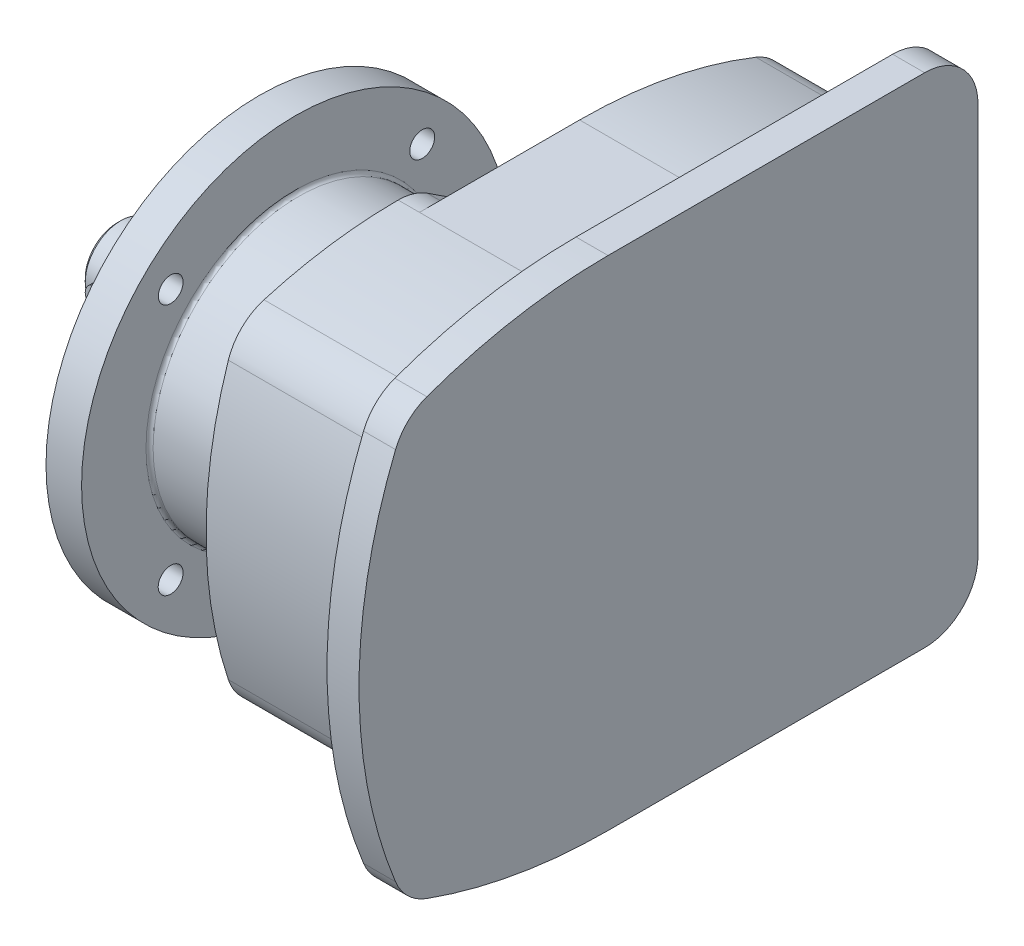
ISO-10303-21;
HEADER;
FILE_DESCRIPTION(('STEP AP214'),'2;1');
FILE_NAME('part.step','',(''),(''),'','','');
FILE_SCHEMA(('AUTOMOTIVE_DESIGN { 1 0 10303 214 1 1 1 1 }'));
ENDSEC;
DATA;
#1=APPLICATION_CONTEXT('core data for automotive mechanical design processes');
#2=APPLICATION_PROTOCOL_DEFINITION('international standard','automotive_design',2000,#1);
#3=PRODUCT_CONTEXT('',#1,'mechanical');
#4=PRODUCT('Part','Part','',(#3));
#5=PRODUCT_RELATED_PRODUCT_CATEGORY('part','',(#4));
#6=PRODUCT_DEFINITION_FORMATION('','',#4);
#7=PRODUCT_DEFINITION_CONTEXT('part definition',#1,'design');
#8=PRODUCT_DEFINITION('design','',#6,#7);
#9=PRODUCT_DEFINITION_SHAPE('','',#8);
#10=(LENGTH_UNIT() NAMED_UNIT(*) SI_UNIT(.MILLI.,.METRE.));
#11=(NAMED_UNIT(*) PLANE_ANGLE_UNIT() SI_UNIT($,.RADIAN.));
#12=(NAMED_UNIT(*) SI_UNIT($,.STERADIAN.) SOLID_ANGLE_UNIT());
#13=UNCERTAINTY_MEASURE_WITH_UNIT(LENGTH_MEASURE(1.E-05),#10,'distance_accuracy_value','');
#14=(GEOMETRIC_REPRESENTATION_CONTEXT(3) GLOBAL_UNCERTAINTY_ASSIGNED_CONTEXT((#13)) GLOBAL_UNIT_ASSIGNED_CONTEXT((#10,
#11,#12)) REPRESENTATION_CONTEXT('',''));
#15=CARTESIAN_POINT('',(0.,0.,0.));
#16=DIRECTION('',(0.,0.,1.));
#17=DIRECTION('',(1.,0.,0.));
#18=AXIS2_PLACEMENT_3D('',#15,#16,#17);
#19=CARTESIAN_POINT('',(20.,0.,12.5));
#20=DIRECTION('',(0.,0.,1.));
#21=DIRECTION('',(1.,0.,0.));
#22=AXIS2_PLACEMENT_3D('',#19,#20,#21);
#23=PLANE('',#22);
#24=DIRECTION('',(1.,0.,0.));
#25=VECTOR('',#24,1.);
#26=CARTESIAN_POINT('',(6.5,3.,12.5));
#27=LINE('',#26,#25);
#28=CARTESIAN_POINT('',(6.5,3.,12.5));
#29=VERTEX_POINT('',#28);
#30=CARTESIAN_POINT('',(33.5,3.,12.5));
#31=VERTEX_POINT('',#30);
#32=EDGE_CURVE('E217',#29,#31,#27,.T.);
#33=ORIENTED_EDGE('',*,*,#32,.F.);
#34=CARTESIAN_POINT('',(6.5,0.,12.5));
#35=DIRECTION('',(0.,0.,1.));
#36=DIRECTION('',(1.,0.,0.));
#37=AXIS2_PLACEMENT_3D('',#34,#35,#36);
#38=CIRCLE('',#37,3.);
#39=CARTESIAN_POINT('',(6.5,-3.,12.5));
#40=VERTEX_POINT('',#39);
#41=EDGE_CURVE('E232',#40,#29,#38,.F.);
#42=ORIENTED_EDGE('',*,*,#41,.F.);
#43=DIRECTION('',(1.,0.,0.));
#44=VECTOR('',#43,1.);
#45=CARTESIAN_POINT('',(33.5,-3.,12.5));
#46=LINE('',#45,#44);
#47=CARTESIAN_POINT('',(33.5,-3.,12.5));
#48=VERTEX_POINT('',#47);
#49=EDGE_CURVE('E230',#48,#40,#46,.F.);
#50=ORIENTED_EDGE('',*,*,#49,.F.);
#51=CARTESIAN_POINT('',(33.5,0.,12.5));
#52=DIRECTION('',(0.,0.,1.));
#53=DIRECTION('',(1.,0.,0.));
#54=AXIS2_PLACEMENT_3D('',#51,#52,#53);
#55=CIRCLE('',#54,3.);
#56=EDGE_CURVE('E20',#31,#48,#55,.F.);
#57=ORIENTED_EDGE('',*,*,#56,.F.);
#58=EDGE_LOOP('',(#33,#42,#50,#57));
#59=FACE_BOUND('',#58,.T.);
#60=ADVANCED_FACE('F16',(#59),#23,.T.);
#61=CARTESIAN_POINT('',(0.,0.,4.49987450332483));
#62=DIRECTION('',(-1.,0.,0.));
#63=DIRECTION('',(0.,0.,1.));
#64=AXIS2_PLACEMENT_3D('',#61,#62,#63);
#65=PLANE('',#64);
#66=CARTESIAN_POINT('',(0.,0.,0.));
#67=DIRECTION('',(1.,0.,0.));
#68=DIRECTION('',(0.,0.,-1.));
#69=AXIS2_PLACEMENT_3D('',#66,#67,#68);
#70=CIRCLE('',#69,8.99974900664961);
#71=CARTESIAN_POINT('',(0.,0.,-8.99974900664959));
#72=VERTEX_POINT('',#71);
#73=EDGE_CURVE('E257',#72,#72,#70,.T.);
#74=ORIENTED_EDGE('',*,*,#73,.F.);
#75=EDGE_LOOP('',(#74));
#76=FACE_BOUND('',#75,.T.);
#77=ADVANCED_FACE('F528',(#76),#65,.T.);
#78=CARTESIAN_POINT('',(6.5,3.,0.));
#79=DIRECTION('',(0.,1.,0.));
#80=DIRECTION('',(0.,0.,1.));
#81=AXIS2_PLACEMENT_3D('',#78,#79,#80);
#82=PLANE('',#81);
#83=ORIENTED_EDGE('',*,*,#32,.T.);
#84=DIRECTION('',(0.,0.,1.));
#85=VECTOR('',#84,1.);
#86=CARTESIAN_POINT('',(33.5,3.,0.));
#87=LINE('',#86,#85);
#88=CARTESIAN_POINT('',(33.5,3.,9.53912890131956));
#89=VERTEX_POINT('',#88);
#90=EDGE_CURVE('E227',#89,#31,#87,.T.);
#91=ORIENTED_EDGE('',*,*,#90,.F.);
#92=DIRECTION('',(-1.,0.,0.));
#93=VECTOR('',#92,1.);
#94=CARTESIAN_POINT('',(2.25,3.,9.53912890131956));
#95=LINE('',#94,#93);
#96=CARTESIAN_POINT('',(6.5,3.,9.53912890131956));
#97=VERTEX_POINT('',#96);
#98=EDGE_CURVE('E253',#97,#89,#95,.F.);
#99=ORIENTED_EDGE('',*,*,#98,.F.);
#100=DIRECTION('',(0.,0.,1.));
#101=VECTOR('',#100,1.);
#102=CARTESIAN_POINT('',(6.5,3.,0.));
#103=LINE('',#102,#101);
#104=EDGE_CURVE('E258',#29,#97,#103,.F.);
#105=ORIENTED_EDGE('',*,*,#104,.F.);
#106=EDGE_LOOP('',(#83,#91,#99,#105));
#107=FACE_BOUND('',#106,.T.);
#108=ADVANCED_FACE('F530',(#107),#82,.T.);
#109=CARTESIAN_POINT('',(33.5,0.,9.52136367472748));
#110=DIRECTION('',(0.,0.,1.));
#111=DIRECTION('',(1.,0.,0.));
#112=AXIS2_PLACEMENT_3D('',#109,#110,#111);
#113=CYLINDRICAL_SURFACE('',#112,3.);
#114=ORIENTED_EDGE('',*,*,#56,.T.);
#115=DIRECTION('',(0.,0.,-1.));
#116=VECTOR('',#115,1.);
#117=CARTESIAN_POINT('',(33.5,-3.,0.));
#118=LINE('',#117,#116);
#119=CARTESIAN_POINT('',(33.5,-3.,9.53912890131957));
#120=VERTEX_POINT('',#119);
#121=EDGE_CURVE('E225',#120,#48,#118,.F.);
#122=ORIENTED_EDGE('',*,*,#121,.F.);
#123=CARTESIAN_POINT('',(33.5,3.,9.53912890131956));
#124=CARTESIAN_POINT('',(33.5823354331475,3.00001027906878,9.53911742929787));
#125=CARTESIAN_POINT('',(33.6646642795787,2.9966106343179,9.54019463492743));
#126=CARTESIAN_POINT('',(33.8286936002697,2.98307146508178,9.54444114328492));
#127=CARTESIAN_POINT('',(33.9103942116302,2.97293345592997,9.54760997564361));
#128=CARTESIAN_POINT('',(34.0723842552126,2.94603153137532,9.55594399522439));
#129=CARTESIAN_POINT('',(34.1526767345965,2.9292844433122,9.56110411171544));
#130=CARTESIAN_POINT('',(34.3114747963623,2.889328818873,9.57325400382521));
#131=CARTESIAN_POINT('',(34.3899803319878,2.86612011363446,9.58024382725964));
#132=CARTESIAN_POINT('',(34.6219502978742,2.78708562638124,9.60365510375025));
#133=CARTESIAN_POINT('',(34.7720714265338,2.72181733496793,9.62252961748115));
#134=CARTESIAN_POINT('',(35.0592282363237,2.5681488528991,9.66467283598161));
#135=CARTESIAN_POINT('',(35.1962582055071,2.47973862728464,9.68794344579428));
#136=CARTESIAN_POINT('',(35.4577082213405,2.2793106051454,9.73707594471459));
#137=CARTESIAN_POINT('',(35.581659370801,2.16669343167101,9.76299267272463));
#138=CARTESIAN_POINT('',(35.8092522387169,1.92230341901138,9.81403533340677));
#139=CARTESIAN_POINT('',(35.9128867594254,1.79052381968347,9.8391609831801));
#140=CARTESIAN_POINT('',(36.0989698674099,1.50815856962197,9.88642198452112));
#141=CARTESIAN_POINT('',(36.1809258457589,1.35723506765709,9.90848314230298));
#142=CARTESIAN_POINT('',(36.3180311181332,1.04307167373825,9.9464519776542));
#143=CARTESIAN_POINT('',(36.3732129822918,0.879847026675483,9.96236712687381));
#144=CARTESIAN_POINT('',(36.4425353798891,0.596550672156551,9.9826242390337));
#145=CARTESIAN_POINT('',(36.4640434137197,0.478375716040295,9.98901125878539));
#146=CARTESIAN_POINT('',(36.4927780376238,0.240149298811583,9.99757530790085));
#147=CARTESIAN_POINT('',(36.5000051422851,0.12009790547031,9.99975248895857));
#148=CARTESIAN_POINT('',(36.4999929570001,-0.164489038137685,9.99974423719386));
#149=CARTESIAN_POINT('',(36.4864191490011,-0.329065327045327,9.99564882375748));
#150=CARTESIAN_POINT('',(36.4325828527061,-0.65349020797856,9.97969862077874));
#151=CARTESIAN_POINT('',(36.3922964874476,-0.813334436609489,9.96783688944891));
#152=CARTESIAN_POINT('',(36.2865056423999,-1.12346871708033,9.93765768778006));
#153=CARTESIAN_POINT('',(36.2210447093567,-1.27377474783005,9.9193513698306));
#154=CARTESIAN_POINT('',(36.066920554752,-1.56126023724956,9.87818629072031));
#155=CARTESIAN_POINT('',(35.9782564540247,-1.69843919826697,9.85532735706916));
#156=CARTESIAN_POINT('',(35.7775568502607,-1.95973760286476,9.80675991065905));
#157=CARTESIAN_POINT('',(35.6649758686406,-2.08342717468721,9.78099296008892));
#158=CARTESIAN_POINT('',(35.4207899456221,-2.31049108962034,9.72986050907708));
#159=CARTESIAN_POINT('',(35.2891808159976,-2.41386094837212,9.70449509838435));
#160=CARTESIAN_POINT('',(35.0070191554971,-2.59962887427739,9.65641517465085));
#161=CARTESIAN_POINT('',(34.8561032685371,-2.68149532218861,9.63377424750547));
#162=CARTESIAN_POINT('',(34.5419019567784,-2.81846568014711,9.59459931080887));
#163=CARTESIAN_POINT('',(34.3786276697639,-2.87359336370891,9.57805987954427));
#164=CARTESIAN_POINT('',(34.095462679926,-2.94274394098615,9.55699414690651));
#165=CARTESIAN_POINT('',(33.9774868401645,-2.96416994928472,9.55034386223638));
#166=CARTESIAN_POINT('',(33.7396984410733,-2.99281294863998,9.54138931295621));
#167=CARTESIAN_POINT('',(33.6198864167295,-3.00003400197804,9.5390838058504));
#168=CARTESIAN_POINT('',(33.5,-3.,9.53912890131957));
#169=B_SPLINE_CURVE_WITH_KNOTS('',3,(#123,#124,#125,#126,#127,#128,#129,#130,#131,#132,#133,
#134,#135,#136,#137,#138,#139,#140,#141,#142,#143,#144,#145,#146,#147,#148,#149,#150,#151,#152,
#153,#154,#155,#156,#157,#158,#159,#160,#161,#162,#163,#164,#165,#166,#167,#168),.UNSPECIFIED.,
.F.,.F.,(4,2,2,2,2,2,2,2,2,2,2,2,2,2,2,2,2,2,2,2,2,2,4),(0.,0.246917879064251,0.493780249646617,
0.740018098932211,0.986262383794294,1.47813926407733,1.97022978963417,2.47630177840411,
2.98255273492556,3.49947462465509,4.01576610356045,4.37574541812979,4.73571176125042,
5.22873049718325,5.72219051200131,6.21480075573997,6.7074296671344,7.21280811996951,
7.71829797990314,8.23530762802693,8.75185675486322,9.11124272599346,9.47052590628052),.UNSPECIFIED.);
#170=EDGE_CURVE('E256',#89,#120,#169,.T.);
#171=ORIENTED_EDGE('',*,*,#170,.F.);
#172=ORIENTED_EDGE('',*,*,#90,.T.);
#173=EDGE_LOOP('',(#114,#122,#171,#172));
#174=FACE_BOUND('',#173,.T.);
#175=ADVANCED_FACE('F223',(#174),#113,.T.);
#176=CARTESIAN_POINT('',(33.5,-3.,0.));
#177=DIRECTION('',(0.,-1.,0.));
#178=DIRECTION('',(0.,0.,-1.));
#179=AXIS2_PLACEMENT_3D('',#176,#177,#178);
#180=PLANE('',#179);
#181=ORIENTED_EDGE('',*,*,#49,.T.);
#182=DIRECTION('',(0.,0.,1.));
#183=VECTOR('',#182,1.);
#184=CARTESIAN_POINT('',(6.5,-3.,0.));
#185=LINE('',#184,#183);
#186=CARTESIAN_POINT('',(6.5,-3.,9.53912890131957));
#187=VERTEX_POINT('',#186);
#188=EDGE_CURVE('E235',#187,#40,#185,.T.);
#189=ORIENTED_EDGE('',*,*,#188,.F.);
#190=DIRECTION('',(-1.,0.,0.));
#191=VECTOR('',#190,1.);
#192=CARTESIAN_POINT('',(2.25,-3.,9.53912890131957));
#193=LINE('',#192,#191);
#194=EDGE_CURVE('E239',#120,#187,#193,.T.);
#195=ORIENTED_EDGE('',*,*,#194,.F.);
#196=ORIENTED_EDGE('',*,*,#121,.T.);
#197=EDGE_LOOP('',(#181,#189,#195,#196));
#198=FACE_BOUND('',#197,.T.);
#199=ADVANCED_FACE('F237',(#198),#180,.T.);
#200=CARTESIAN_POINT('',(6.5,0.,9.52136367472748));
#201=DIRECTION('',(0.,0.,1.));
#202=DIRECTION('',(1.,0.,0.));
#203=AXIS2_PLACEMENT_3D('',#200,#201,#202);
#204=CYLINDRICAL_SURFACE('',#203,3.);
#205=ORIENTED_EDGE('',*,*,#41,.T.);
#206=ORIENTED_EDGE('',*,*,#104,.T.);
#207=CARTESIAN_POINT('',(6.5,-3.,9.53912890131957));
#208=CARTESIAN_POINT('',(6.41766456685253,-3.00001027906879,9.53911742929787));
#209=CARTESIAN_POINT('',(6.3353357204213,-2.9966106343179,9.54019463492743));
#210=CARTESIAN_POINT('',(6.17130639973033,-2.98307146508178,9.54444114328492));
#211=CARTESIAN_POINT('',(6.0896057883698,-2.97293345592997,9.54760997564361));
#212=CARTESIAN_POINT('',(5.92761574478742,-2.94603153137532,9.55594399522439));
#213=CARTESIAN_POINT('',(5.8473232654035,-2.92928444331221,9.56110411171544));
#214=CARTESIAN_POINT('',(5.68852520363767,-2.88932881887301,9.57325400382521));
#215=CARTESIAN_POINT('',(5.61001966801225,-2.86612011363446,9.58024382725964));
#216=CARTESIAN_POINT('',(5.37804970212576,-2.78708562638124,9.60365510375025));
#217=CARTESIAN_POINT('',(5.22792857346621,-2.72181733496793,9.62252961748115));
#218=CARTESIAN_POINT('',(4.94077176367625,-2.5681488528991,9.66467283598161));
#219=CARTESIAN_POINT('',(4.80374179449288,-2.47973862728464,9.68794344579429));
#220=CARTESIAN_POINT('',(4.54229177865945,-2.2793106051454,9.73707594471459));
#221=CARTESIAN_POINT('',(4.41834062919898,-2.16669343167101,9.76299267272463));
#222=CARTESIAN_POINT('',(4.19074776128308,-1.92230341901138,9.81403533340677));
#223=CARTESIAN_POINT('',(4.08711324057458,-1.79052381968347,9.8391609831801));
#224=CARTESIAN_POINT('',(3.90103013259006,-1.50815856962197,9.88642198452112));
#225=CARTESIAN_POINT('',(3.81907415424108,-1.35723506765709,9.90848314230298));
#226=CARTESIAN_POINT('',(3.68196888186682,-1.04307167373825,9.9464519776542));
#227=CARTESIAN_POINT('',(3.62678701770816,-0.879847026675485,9.96236712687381));
#228=CARTESIAN_POINT('',(3.55746462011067,-0.596550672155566,9.98262423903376));
#229=CARTESIAN_POINT('',(3.53595658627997,-0.478375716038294,9.9890112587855));
#230=CARTESIAN_POINT('',(3.50722196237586,-0.240149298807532,9.99757530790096));
#231=CARTESIAN_POINT('',(3.49999485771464,-0.120097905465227,9.99975248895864));
#232=CARTESIAN_POINT('',(3.5000070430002,0.164489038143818,9.99974423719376));
#233=CARTESIAN_POINT('',(3.51358085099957,0.329065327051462,9.99564882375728));
#234=CARTESIAN_POINT('',(3.56741714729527,0.653490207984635,9.97969862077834));
#235=CARTESIAN_POINT('',(3.60770351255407,0.813334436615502,9.96783688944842));
#236=CARTESIAN_POINT('',(3.71349435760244,1.12346871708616,9.9376576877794));
#237=CARTESIAN_POINT('',(3.77895529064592,1.27377474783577,9.91935136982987));
#238=CARTESIAN_POINT('',(3.93307944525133,1.56126023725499,9.87818629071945));
#239=CARTESIAN_POINT('',(4.02174354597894,1.69843919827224,9.85532735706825));
#240=CARTESIAN_POINT('',(4.22244314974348,1.95973760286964,9.80675991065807));
#241=CARTESIAN_POINT('',(4.33502413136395,2.08342717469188,9.78099296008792));
#242=CARTESIAN_POINT('',(4.57921005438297,2.31049108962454,9.72986050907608));
#243=CARTESIAN_POINT('',(4.71081918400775,2.41386094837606,9.70449509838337));
#244=CARTESIAN_POINT('',(4.99298084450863,2.59962887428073,9.65641517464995));
#245=CARTESIAN_POINT('',(5.14389673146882,2.68149532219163,9.63377424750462));
#246=CARTESIAN_POINT('',(5.4580980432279,2.81846568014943,9.59459931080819));
#247=CARTESIAN_POINT('',(5.62137233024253,2.87359336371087,9.57805987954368));
#248=CARTESIAN_POINT('',(5.90453732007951,2.94274394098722,9.55699414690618));
#249=CARTESIAN_POINT('',(6.02251315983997,2.96416994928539,9.55034386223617));
#250=CARTESIAN_POINT('',(6.26030155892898,2.99281294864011,9.54138931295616));
#251=CARTESIAN_POINT('',(6.38011358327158,3.00003400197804,9.5390838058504));
#252=CARTESIAN_POINT('',(6.5,3.,9.53912890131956));
#253=B_SPLINE_CURVE_WITH_KNOTS('',3,(#207,#208,#209,#210,#211,#212,#213,#214,#215,#216,#217,
#218,#219,#220,#221,#222,#223,#224,#225,#226,#227,#228,#229,#230,#231,#232,#233,#234,#235,#236,
#237,#238,#239,#240,#241,#242,#243,#244,#245,#246,#247,#248,#249,#250,#251,#252),.UNSPECIFIED.,
.F.,.F.,(4,2,2,2,2,2,2,2,2,2,2,2,2,2,2,2,2,2,2,2,2,2,4),(0.,0.246917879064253,0.493780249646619,
0.740018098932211,0.986262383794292,1.47813926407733,1.97022978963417,2.47630177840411,
2.98255273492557,3.49947462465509,4.01576610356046,4.37574541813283,4.73571176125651,
5.22873049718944,5.72219051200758,6.21480075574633,6.70742966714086,7.21280811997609,
7.71829797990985,8.23530762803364,8.75185675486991,9.11124272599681,9.47052590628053),.UNSPECIFIED.);
#254=EDGE_CURVE('E263',#187,#97,#253,.T.);
#255=ORIENTED_EDGE('',*,*,#254,.F.);
#256=ORIENTED_EDGE('',*,*,#188,.T.);
#257=EDGE_LOOP('',(#205,#206,#255,#256));
#258=FACE_BOUND('',#257,.T.);
#259=ADVANCED_FACE('F460',(#258),#204,.T.);
#260=CARTESIAN_POINT('',(0.999999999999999,0.,0.));
#261=DIRECTION('',(1.,0.,0.));
#262=DIRECTION('',(0.,0.,-1.));
#263=AXIS2_PLACEMENT_3D('',#260,#261,#262);
#264=CONICAL_SURFACE('',#263,9.99974900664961,0.785398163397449);
#265=ORIENTED_EDGE('',*,*,#73,.T.);
#266=EDGE_LOOP('',(#265));
#267=FACE_BOUND('',#266,.T.);
#268=CARTESIAN_POINT('',(1.,0.,0.));
#269=DIRECTION('',(-1.,0.,0.));
#270=DIRECTION('',(0.,7.62993006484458E-13,1.));
#271=AXIS2_PLACEMENT_3D('',#268,#269,#270);
#272=CIRCLE('',#271,9.99974900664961);
#273=CARTESIAN_POINT('',(1.,7.62714531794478E-12,9.99974900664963));
#274=VERTEX_POINT('',#273);
#275=EDGE_CURVE('E249',#274,#274,#272,.F.);
#276=ORIENTED_EDGE('',*,*,#275,.F.);
#277=EDGE_LOOP('',(#276));
#278=FACE_BOUND('',#277,.T.);
#279=ADVANCED_FACE('F469',(#267,#278),#264,.T.);
#280=CARTESIAN_POINT('',(38.000133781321,0.,0.));
#281=DIRECTION('',(-1.,0.,0.));
#282=DIRECTION('',(0.,0.,1.));
#283=AXIS2_PLACEMENT_3D('',#280,#281,#282);
#284=CYLINDRICAL_SURFACE('',#283,9.99974900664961);
#285=ORIENTED_EDGE('',*,*,#98,.T.);
#286=ORIENTED_EDGE('',*,*,#170,.T.);
#287=ORIENTED_EDGE('',*,*,#194,.T.);
#288=ORIENTED_EDGE('',*,*,#254,.T.);
#289=EDGE_LOOP('',(#285,#286,#287,#288));
#290=FACE_BOUND('',#289,.T.);
#291=ORIENTED_EDGE('',*,*,#275,.T.);
#292=EDGE_LOOP('',(#291));
#293=FACE_BOUND('',#292,.T.);
#294=CARTESIAN_POINT('',(38.000133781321,0.,0.));
#295=DIRECTION('',(-1.,0.,0.));
#296=DIRECTION('',(0.,0.,1.));
#297=AXIS2_PLACEMENT_3D('',#294,#295,#296);
#298=CIRCLE('',#297,9.99974900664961);
#299=CARTESIAN_POINT('',(38.000133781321,0.,9.99974900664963));
#300=VERTEX_POINT('',#299);
#301=EDGE_CURVE('E245',#300,#300,#298,.F.);
#302=ORIENTED_EDGE('',*,*,#301,.F.);
#303=EDGE_LOOP('',(#302));
#304=FACE_BOUND('',#303,.T.);
#305=ADVANCED_FACE('F464',(#290,#293,#304),#284,.T.);
#306=CARTESIAN_POINT('',(38.8307961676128,0.,0.));
#307=DIRECTION('',(-1.,0.,0.));
#308=DIRECTION('',(0.,0.,1.));
#309=AXIS2_PLACEMENT_3D('',#306,#307,#308);
#310=TOROIDAL_SURFACE('',#309,10.9997490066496,1.30000000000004);
#311=CARTESIAN_POINT('',(39.9729968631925,0.,0.));
#312=DIRECTION('',(1.,0.,0.));
#313=DIRECTION('',(0.,7.62993006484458E-13,1.));
#314=AXIS2_PLACEMENT_3D('',#311,#312,#313);
#315=CIRCLE('',#314,10.3789611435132);
#316=CARTESIAN_POINT('',(39.9729968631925,7.91648152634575E-12,10.3789611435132));
#317=VERTEX_POINT('',#316);
#318=EDGE_CURVE('E248',#317,#317,#315,.T.);
#319=ORIENTED_EDGE('',*,*,#318,.F.);
#320=EDGE_LOOP('',(#319));
#321=FACE_BOUND('',#320,.T.);
#322=ORIENTED_EDGE('',*,*,#301,.T.);
#323=EDGE_LOOP('',(#322));
#324=FACE_BOUND('',#323,.T.);
#325=ADVANCED_FACE('F468',(#321,#324),#310,.F.);
#326=CARTESIAN_POINT('',(40.0009332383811,0.,0.));
#327=DIRECTION('',(1.,0.,0.));
#328=DIRECTION('',(0.,0.,-1.));
#329=AXIS2_PLACEMENT_3D('',#326,#327,#328);
#330=CONICAL_SURFACE('',#329,11.0214633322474,1.52734310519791);
#331=ORIENTED_EDGE('',*,*,#318,.T.);
#332=EDGE_LOOP('',(#331));
#333=FACE_BOUND('',#332,.T.);
#334=CARTESIAN_POINT('',(40.0009332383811,0.,0.));
#335=DIRECTION('',(1.,0.,0.));
#336=DIRECTION('',(0.,0.,-1.));
#337=AXIS2_PLACEMENT_3D('',#334,#335,#336);
#338=CIRCLE('',#337,11.0214633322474);
#339=CARTESIAN_POINT('',(40.0009332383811,0.,-11.0214633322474));
#340=VERTEX_POINT('',#339);
#341=EDGE_CURVE('E446',#340,#340,#338,.T.);
#342=ORIENTED_EDGE('',*,*,#341,.F.);
#343=EDGE_LOOP('',(#342));
#344=FACE_BOUND('',#343,.T.);
#345=ADVANCED_FACE('F475',(#333,#344),#330,.T.);
#346=CARTESIAN_POINT('',(40.0009332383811,0.,7.50000000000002));
#347=DIRECTION('',(-1.,0.,0.));
#348=DIRECTION('',(0.,0.,1.));
#349=AXIS2_PLACEMENT_3D('',#346,#347,#348);
#350=PLANE('',#349);
#351=CARTESIAN_POINT('',(40.0009332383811,0.,0.));
#352=DIRECTION('',(-1.,0.,0.));
#353=DIRECTION('',(0.,0.,1.));
#354=AXIS2_PLACEMENT_3D('',#351,#352,#353);
#355=CIRCLE('',#354,15.);
#356=CARTESIAN_POINT('',(40.0009332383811,0.,15.));
#357=VERTEX_POINT('',#356);
#358=EDGE_CURVE('E443',#357,#357,#355,.F.);
#359=ORIENTED_EDGE('',*,*,#358,.F.);
#360=EDGE_LOOP('',(#359));
#361=FACE_BOUND('',#360,.T.);
#362=ORIENTED_EDGE('',*,*,#341,.T.);
#363=EDGE_LOOP('',(#362));
#364=FACE_BOUND('',#363,.T.);
#365=ADVANCED_FACE('F839',(#361,#364),#350,.T.);
#366=CARTESIAN_POINT('',(40.9729968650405,0.,0.));
#367=DIRECTION('',(-1.,0.,0.));
#368=DIRECTION('',(0.,0.,1.));
#369=AXIS2_PLACEMENT_3D('',#366,#367,#368);
#370=CYLINDRICAL_SURFACE('',#369,15.);
#371=ORIENTED_EDGE('',*,*,#358,.T.);
#372=EDGE_LOOP('',(#371));
#373=FACE_BOUND('',#372,.T.);
#374=CARTESIAN_POINT('',(40.9729968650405,0.,0.));
#375=DIRECTION('',(-1.,0.,0.));
#376=DIRECTION('',(0.,0.,1.));
#377=AXIS2_PLACEMENT_3D('',#374,#375,#376);
#378=CIRCLE('',#377,15.);
#379=CARTESIAN_POINT('',(40.9729968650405,0.,15.));
#380=VERTEX_POINT('',#379);
#381=EDGE_CURVE('E440',#380,#380,#378,.T.);
#382=ORIENTED_EDGE('',*,*,#381,.T.);
#383=EDGE_LOOP('',(#382));
#384=FACE_BOUND('',#383,.T.);
#385=ADVANCED_FACE('F834',(#373,#384),#370,.T.);
#386=CARTESIAN_POINT('',(40.9729968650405,0.,26.));
#387=DIRECTION('',(1.,0.,0.));
#388=DIRECTION('',(0.,0.,-1.));
#389=AXIS2_PLACEMENT_3D('',#386,#387,#388);
#390=PLANE('',#389);
#391=CARTESIAN_POINT('',(40.9729968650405,0.,0.));
#392=DIRECTION('',(-1.,0.,0.));
#393=DIRECTION('',(0.,0.,1.));
#394=AXIS2_PLACEMENT_3D('',#391,#392,#393);
#395=CIRCLE('',#394,37.);
#396=CARTESIAN_POINT('',(40.9729968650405,0.,37.));
#397=VERTEX_POINT('',#396);
#398=EDGE_CURVE('E437',#397,#397,#395,.T.);
#399=ORIENTED_EDGE('',*,*,#398,.T.);
#400=EDGE_LOOP('',(#399));
#401=FACE_BOUND('',#400,.T.);
#402=ORIENTED_EDGE('',*,*,#381,.F.);
#403=EDGE_LOOP('',(#402));
#404=FACE_BOUND('',#403,.T.);
#405=ADVANCED_FACE('F829',(#401,#404),#390,.F.);
#406=CARTESIAN_POINT('',(40.9729968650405,0.,0.));
#407=DIRECTION('',(-1.,0.,0.));
#408=DIRECTION('',(0.,0.,1.));
#409=AXIS2_PLACEMENT_3D('',#406,#407,#408);
#410=CYLINDRICAL_SURFACE('',#409,37.);
#411=ORIENTED_EDGE('',*,*,#398,.F.);
#412=EDGE_LOOP('',(#411));
#413=FACE_BOUND('',#412,.T.);
#414=CARTESIAN_POINT('',(36.9729968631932,0.,0.));
#415=DIRECTION('',(-1.,0.,0.));
#416=DIRECTION('',(0.,0.,1.));
#417=AXIS2_PLACEMENT_3D('',#414,#415,#416);
#418=CIRCLE('',#417,37.);
#419=CARTESIAN_POINT('',(36.9729968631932,0.,37.));
#420=VERTEX_POINT('',#419);
#421=EDGE_CURVE('E434',#420,#420,#418,.F.);
#422=ORIENTED_EDGE('',*,*,#421,.F.);
#423=EDGE_LOOP('',(#422));
#424=FACE_BOUND('',#423,.T.);
#425=ADVANCED_FACE('F824',(#413,#424),#410,.F.);
#426=CARTESIAN_POINT('',(36.9729968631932,0.,33.9153222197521));
#427=DIRECTION('',(-1.,0.,0.));
#428=DIRECTION('',(0.,0.,1.));
#429=AXIS2_PLACEMENT_3D('',#426,#427,#428);
#430=PLANE('',#429);
#431=CARTESIAN_POINT('',(36.9729968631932,0.,0.));
#432=DIRECTION('',(-1.,0.,0.));
#433=DIRECTION('',(0.,0.,1.));
#434=AXIS2_PLACEMENT_3D('',#431,#432,#433);
#435=CIRCLE('',#434,39.9999999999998);
#436=CARTESIAN_POINT('',(36.9729968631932,0.,39.9999999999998));
#437=VERTEX_POINT('',#436);
#438=EDGE_CURVE('E431',#437,#437,#435,.F.);
#439=ORIENTED_EDGE('',*,*,#438,.F.);
#440=EDGE_LOOP('',(#439));
#441=FACE_BOUND('',#440,.T.);
#442=ORIENTED_EDGE('',*,*,#421,.T.);
#443=EDGE_LOOP('',(#442));
#444=FACE_BOUND('',#443,.T.);
#445=ADVANCED_FACE('F819',(#441,#444),#430,.T.);
#446=CARTESIAN_POINT('',(39.9729968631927,0.,0.));
#447=DIRECTION('',(-1.,0.,0.));
#448=DIRECTION('',(0.,0.,1.));
#449=AXIS2_PLACEMENT_3D('',#446,#447,#448);
#450=CYLINDRICAL_SURFACE('',#449,39.9999999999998);
#451=ORIENTED_EDGE('',*,*,#438,.T.);
#452=EDGE_LOOP('',(#451));
#453=FACE_BOUND('',#452,.T.);
#454=CARTESIAN_POINT('',(39.9729968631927,0.,0.));
#455=DIRECTION('',(-1.,0.,0.));
#456=DIRECTION('',(0.,0.,1.));
#457=AXIS2_PLACEMENT_3D('',#454,#455,#456);
#458=CIRCLE('',#457,39.9999999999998);
#459=CARTESIAN_POINT('',(39.9729968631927,0.,39.9999999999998));
#460=VERTEX_POINT('',#459);
#461=EDGE_CURVE('E428',#460,#460,#458,.F.);
#462=ORIENTED_EDGE('',*,*,#461,.F.);
#463=EDGE_LOOP('',(#462));
#464=FACE_BOUND('',#463,.T.);
#465=ADVANCED_FACE('F814',(#453,#464),#450,.T.);
#466=CARTESIAN_POINT('',(39.9729968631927,0.,49.999996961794));
#467=DIRECTION('',(-1.,0.,0.));
#468=DIRECTION('',(0.,0.,1.));
#469=AXIS2_PLACEMENT_3D('',#466,#467,#468);
#470=PLANE('',#469);
#471=CARTESIAN_POINT('',(39.9729968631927,0.,0.));
#472=DIRECTION('',(-1.,0.,0.));
#473=DIRECTION('',(0.,0.,1.));
#474=AXIS2_PLACEMENT_3D('',#471,#472,#473);
#475=CIRCLE('',#474,59.9999939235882);
#476=CARTESIAN_POINT('',(39.9729968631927,0.,59.9999939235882));
#477=VERTEX_POINT('',#476);
#478=EDGE_CURVE('E413',#477,#477,#475,.F.);
#479=ORIENTED_EDGE('',*,*,#478,.F.);
#480=EDGE_LOOP('',(#479));
#481=FACE_BOUND('',#480,.T.);
#482=ORIENTED_EDGE('',*,*,#461,.T.);
#483=EDGE_LOOP('',(#482));
#484=FACE_BOUND('',#483,.T.);
#485=CARTESIAN_POINT('',(39.9729968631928,-35.4657611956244,-35.7552880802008));
#486=DIRECTION('',(1.,0.,0.));
#487=DIRECTION('',(0.,0.,-1.));
#488=AXIS2_PLACEMENT_3D('',#485,#486,#487);
#489=CIRCLE('',#488,3.49999999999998);
#490=CARTESIAN_POINT('',(39.9729968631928,-35.4657611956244,-39.2552880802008));
#491=VERTEX_POINT('',#490);
#492=EDGE_CURVE('E416',#491,#491,#489,.T.);
#493=ORIENTED_EDGE('',*,*,#492,.T.);
#494=EDGE_LOOP('',(#493));
#495=FACE_BOUND('',#494,.T.);
#496=CARTESIAN_POINT('',(39.9729968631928,35.2449169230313,-35.7552880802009));
#497=DIRECTION('',(1.,0.,0.));
#498=DIRECTION('',(0.,0.,-1.));
#499=AXIS2_PLACEMENT_3D('',#496,#497,#498);
#500=CIRCLE('',#499,3.49999999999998);
#501=CARTESIAN_POINT('',(39.9729968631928,35.2449169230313,-39.2552880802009));
#502=VERTEX_POINT('',#501);
#503=EDGE_CURVE('E419',#502,#502,#500,.T.);
#504=ORIENTED_EDGE('',*,*,#503,.T.);
#505=EDGE_LOOP('',(#504));
#506=FACE_BOUND('',#505,.T.);
#507=CARTESIAN_POINT('',(39.9729968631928,35.2592999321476,34.9410011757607));
#508=DIRECTION('',(1.,0.,0.));
#509=DIRECTION('',(0.,0.,-1.));
#510=AXIS2_PLACEMENT_3D('',#507,#508,#509);
#511=CIRCLE('',#510,3.479667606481);
#512=CARTESIAN_POINT('',(39.9729968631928,35.2592999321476,31.4613335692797));
#513=VERTEX_POINT('',#512);
#514=EDGE_CURVE('E422',#513,#513,#511,.T.);
#515=ORIENTED_EDGE('',*,*,#514,.T.);
#516=EDGE_LOOP('',(#515));
#517=FACE_BOUND('',#516,.T.);
#518=CARTESIAN_POINT('',(39.9729968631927,-35.4657611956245,34.955390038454));
#519=DIRECTION('',(1.,0.,0.));
#520=DIRECTION('',(0.,0.,-1.));
#521=AXIS2_PLACEMENT_3D('',#518,#519,#520);
#522=CIRCLE('',#521,3.49999999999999);
#523=CARTESIAN_POINT('',(39.9729968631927,-35.4657611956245,31.455390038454));
#524=VERTEX_POINT('',#523);
#525=EDGE_CURVE('E425',#524,#524,#522,.T.);
#526=ORIENTED_EDGE('',*,*,#525,.T.);
#527=EDGE_LOOP('',(#526));
#528=FACE_BOUND('',#527,.T.);
#529=ADVANCED_FACE('F809',(#481,#484,#495,#506,#517,#528),#470,.T.);
#530=CARTESIAN_POINT('',(39.9729968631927,-35.4657611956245,34.955390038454));
#531=DIRECTION('',(1.,0.,0.));
#532=DIRECTION('',(0.,0.,-1.));
#533=AXIS2_PLACEMENT_3D('',#530,#531,#532);
#534=CYLINDRICAL_SURFACE('',#533,3.49999999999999);
#535=ORIENTED_EDGE('',*,*,#525,.F.);
#536=EDGE_LOOP('',(#535));
#537=FACE_BOUND('',#536,.T.);
#538=CARTESIAN_POINT('',(49.9729968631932,-35.4657611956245,34.955390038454));
#539=DIRECTION('',(1.,0.,0.));
#540=DIRECTION('',(0.,0.,-1.));
#541=AXIS2_PLACEMENT_3D('',#538,#539,#540);
#542=CIRCLE('',#541,3.49999999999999);
#543=CARTESIAN_POINT('',(49.9729968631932,-35.4657611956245,31.455390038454));
#544=VERTEX_POINT('',#543);
#545=EDGE_CURVE('E410',#544,#544,#542,.F.);
#546=ORIENTED_EDGE('',*,*,#545,.F.);
#547=EDGE_LOOP('',(#546));
#548=FACE_BOUND('',#547,.T.);
#549=ADVANCED_FACE('F804',(#537,#548),#534,.F.);
#550=CARTESIAN_POINT('',(39.9729968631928,35.2592999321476,34.9410011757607));
#551=DIRECTION('',(1.,0.,0.));
#552=DIRECTION('',(0.,0.,-1.));
#553=AXIS2_PLACEMENT_3D('',#550,#551,#552);
#554=CYLINDRICAL_SURFACE('',#553,3.479667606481);
#555=ORIENTED_EDGE('',*,*,#514,.F.);
#556=EDGE_LOOP('',(#555));
#557=FACE_BOUND('',#556,.T.);
#558=CARTESIAN_POINT('',(49.9729968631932,35.2592999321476,34.9410011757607));
#559=DIRECTION('',(1.,0.,0.));
#560=DIRECTION('',(0.,0.,-1.));
#561=AXIS2_PLACEMENT_3D('',#558,#559,#560);
#562=CIRCLE('',#561,3.479667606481);
#563=CARTESIAN_POINT('',(49.9729968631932,35.2592999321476,31.4613335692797));
#564=VERTEX_POINT('',#563);
#565=EDGE_CURVE('E407',#564,#564,#562,.F.);
#566=ORIENTED_EDGE('',*,*,#565,.F.);
#567=EDGE_LOOP('',(#566));
#568=FACE_BOUND('',#567,.T.);
#569=ADVANCED_FACE('F799',(#557,#568),#554,.F.);
#570=CARTESIAN_POINT('',(39.9729968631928,35.2449169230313,-35.7552880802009));
#571=DIRECTION('',(1.,0.,0.));
#572=DIRECTION('',(0.,0.,-1.));
#573=AXIS2_PLACEMENT_3D('',#570,#571,#572);
#574=CYLINDRICAL_SURFACE('',#573,3.49999999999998);
#575=ORIENTED_EDGE('',*,*,#503,.F.);
#576=EDGE_LOOP('',(#575));
#577=FACE_BOUND('',#576,.T.);
#578=CARTESIAN_POINT('',(49.9729968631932,35.2449169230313,-35.7552880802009));
#579=DIRECTION('',(1.,0.,0.));
#580=DIRECTION('',(0.,0.,-1.));
#581=AXIS2_PLACEMENT_3D('',#578,#579,#580);
#582=CIRCLE('',#581,3.49999999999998);
#583=CARTESIAN_POINT('',(49.9729968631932,35.2449169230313,-39.2552880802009));
#584=VERTEX_POINT('',#583);
#585=EDGE_CURVE('E404',#584,#584,#582,.F.);
#586=ORIENTED_EDGE('',*,*,#585,.F.);
#587=EDGE_LOOP('',(#586));
#588=FACE_BOUND('',#587,.T.);
#589=ADVANCED_FACE('F795',(#577,#588),#574,.F.);
#590=CARTESIAN_POINT('',(39.9729968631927,-35.4657611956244,-35.7552880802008));
#591=DIRECTION('',(1.,0.,0.));
#592=DIRECTION('',(0.,0.,-1.));
#593=AXIS2_PLACEMENT_3D('',#590,#591,#592);
#594=CYLINDRICAL_SURFACE('',#593,3.49999999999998);
#595=ORIENTED_EDGE('',*,*,#492,.F.);
#596=EDGE_LOOP('',(#595));
#597=FACE_BOUND('',#596,.T.);
#598=CARTESIAN_POINT('',(49.9729968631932,-35.4657611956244,-35.7552880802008));
#599=DIRECTION('',(1.,0.,0.));
#600=DIRECTION('',(0.,0.,-1.));
#601=AXIS2_PLACEMENT_3D('',#598,#599,#600);
#602=CIRCLE('',#601,3.49999999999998);
#603=CARTESIAN_POINT('',(49.9729968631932,-35.4657611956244,-39.2552880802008));
#604=VERTEX_POINT('',#603);
#605=EDGE_CURVE('E401',#604,#604,#602,.F.);
#606=ORIENTED_EDGE('',*,*,#605,.F.);
#607=EDGE_LOOP('',(#606));
#608=FACE_BOUND('',#607,.T.);
#609=ADVANCED_FACE('F791',(#597,#608),#594,.F.);
#610=CARTESIAN_POINT('',(49.9729968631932,0.,0.));
#611=DIRECTION('',(-1.,0.,0.));
#612=DIRECTION('',(0.,0.,1.));
#613=AXIS2_PLACEMENT_3D('',#610,#611,#612);
#614=CYLINDRICAL_SURFACE('',#613,59.9999939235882);
#615=ORIENTED_EDGE('',*,*,#478,.T.);
#616=EDGE_LOOP('',(#615));
#617=FACE_BOUND('',#616,.T.);
#618=CARTESIAN_POINT('',(49.9729968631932,0.,0.));
#619=DIRECTION('',(-1.,0.,0.));
#620=DIRECTION('',(0.,0.,1.));
#621=AXIS2_PLACEMENT_3D('',#618,#619,#620);
#622=CIRCLE('',#621,59.9999939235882);
#623=CARTESIAN_POINT('',(49.9729968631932,0.,59.9999939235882));
#624=VERTEX_POINT('',#623);
#625=EDGE_CURVE('E397',#624,#624,#622,.F.);
#626=ORIENTED_EDGE('',*,*,#625,.F.);
#627=EDGE_LOOP('',(#626));
#628=FACE_BOUND('',#627,.T.);
#629=ADVANCED_FACE('F501',(#617,#628),#614,.T.);
#630=CARTESIAN_POINT('',(49.9729968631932,0.,50.9446651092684));
#631=DIRECTION('',(1.,0.,0.));
#632=DIRECTION('',(0.,0.,-1.));
#633=AXIS2_PLACEMENT_3D('',#630,#631,#632);
#634=PLANE('',#633);
#635=CARTESIAN_POINT('',(49.9729968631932,0.,0.));
#636=DIRECTION('',(1.,0.,0.));
#637=DIRECTION('',(0.,0.,1.));
#638=AXIS2_PLACEMENT_3D('',#635,#636,#637);
#639=CIRCLE('',#638,41.8893362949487);
#640=CARTESIAN_POINT('',(49.9729968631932,0.,41.8893362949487));
#641=VERTEX_POINT('',#640);
#642=EDGE_CURVE('E400',#641,#641,#639,.T.);
#643=ORIENTED_EDGE('',*,*,#642,.F.);
#644=EDGE_LOOP('',(#643));
#645=FACE_BOUND('',#644,.T.);
#646=ORIENTED_EDGE('',*,*,#625,.T.);
#647=EDGE_LOOP('',(#646));
#648=FACE_BOUND('',#647,.T.);
#649=ORIENTED_EDGE('',*,*,#605,.T.);
#650=EDGE_LOOP('',(#649));
#651=FACE_BOUND('',#650,.T.);
#652=ORIENTED_EDGE('',*,*,#585,.T.);
#653=EDGE_LOOP('',(#652));
#654=FACE_BOUND('',#653,.T.);
#655=ORIENTED_EDGE('',*,*,#565,.T.);
#656=EDGE_LOOP('',(#655));
#657=FACE_BOUND('',#656,.T.);
#658=ORIENTED_EDGE('',*,*,#545,.T.);
#659=EDGE_LOOP('',(#658));
#660=FACE_BOUND('',#659,.T.);
#661=ADVANCED_FACE('F490',(#645,#648,#651,#654,#657,#660),#634,.T.);
#662=CARTESIAN_POINT('',(50.9729968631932,0.,0.));
#663=DIRECTION('',(-1.,0.,0.));
#664=DIRECTION('',(0.,0.,1.));
#665=AXIS2_PLACEMENT_3D('',#662,#663,#664);
#666=TOROIDAL_SURFACE('',#665,41.8893362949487,1.);
#667=CARTESIAN_POINT('',(50.9729962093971,0.,0.));
#668=DIRECTION('',(-1.,0.,0.));
#669=DIRECTION('',(0.,7.62993006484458E-13,1.));
#670=AXIS2_PLACEMENT_3D('',#667,#668,#669);
#671=CIRCLE('',#670,40.8893366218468);
#672=CARTESIAN_POINT('',(50.9729962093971,3.11956846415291E-11,40.8893366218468));
#673=VERTEX_POINT('',#672);
#674=EDGE_CURVE('E902',#673,#673,#671,.F.);
#675=ORIENTED_EDGE('',*,*,#674,.F.);
#676=EDGE_LOOP('',(#675));
#677=FACE_BOUND('',#676,.T.);
#678=ORIENTED_EDGE('',*,*,#642,.T.);
#679=EDGE_LOOP('',(#678));
#680=FACE_BOUND('',#679,.T.);
#681=ADVANCED_FACE('F500',(#677,#680),#666,.F.);
#682=CARTESIAN_POINT('',(74.8682164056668,0.,0.));
#683=DIRECTION('',(-1.,0.,0.));
#684=DIRECTION('',(0.,0.,1.));
#685=AXIS2_PLACEMENT_3D('',#682,#683,#684);
#686=CYLINDRICAL_SURFACE('',#685,40.8893366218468);
#687=ORIENTED_EDGE('',*,*,#674,.T.);
#688=EDGE_LOOP('',(#687));
#689=FACE_BOUND('',#688,.T.);
#690=CARTESIAN_POINT('',(74.8682164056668,0.,0.));
#691=DIRECTION('',(-1.,0.,0.));
#692=DIRECTION('',(0.,0.,1.));
#693=AXIS2_PLACEMENT_3D('',#690,#691,#692);
#694=CIRCLE('',#693,40.8893369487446);
#695=CARTESIAN_POINT('',(74.8682164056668,0.,40.8893369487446));
#696=VERTEX_POINT('',#695);
#697=EDGE_CURVE('E905',#696,#696,#694,.F.);
#698=ORIENTED_EDGE('',*,*,#697,.F.);
#699=EDGE_LOOP('',(#698));
#700=FACE_BOUND('',#699,.T.);
#701=ADVANCED_FACE('F506',(#689,#700),#686,.T.);
#702=CARTESIAN_POINT('',(74.8682169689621,0.,0.));
#703=DIRECTION('',(-1.,0.,0.));
#704=DIRECTION('',(0.,0.,1.));
#705=AXIS2_PLACEMENT_3D('',#702,#703,#704);
#706=TOROIDAL_SURFACE('',#705,45.1969830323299,4.3076460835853);
#707=CARTESIAN_POINT('',(78.9506993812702,0.,0.));
#708=DIRECTION('',(-1.,0.,0.));
#709=DIRECTION('',(0.,0.,1.));
#710=AXIS2_PLACEMENT_3D('',#707,#708,#709);
#711=CIRCLE('',#710,43.8225187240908);
#712=CARTESIAN_POINT('',(78.9506993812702,0.,43.8225187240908));
#713=VERTEX_POINT('',#712);
#714=EDGE_CURVE('E619',#713,#713,#711,.F.);
#715=ORIENTED_EDGE('',*,*,#714,.F.);
#716=EDGE_LOOP('',(#715));
#717=FACE_BOUND('',#716,.T.);
#718=ORIENTED_EDGE('',*,*,#697,.T.);
#719=EDGE_LOOP('',(#718));
#720=FACE_BOUND('',#719,.T.);
#721=ADVANCED_FACE('F780',(#717,#720),#706,.F.);
#722=CARTESIAN_POINT('',(79.0454723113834,0.,0.));
#723=DIRECTION('',(-1.,0.,0.));
#724=DIRECTION('',(0.,0.,1.));
#725=AXIS2_PLACEMENT_3D('',#722,#723,#724);
#726=TOROIDAL_SURFACE('',#725,43.7906111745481,0.100000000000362);
#727=ORIENTED_EDGE('',*,*,#714,.T.);
#728=EDGE_LOOP('',(#727));
#729=FACE_BOUND('',#728,.T.);
#730=CARTESIAN_POINT('',(78.9729968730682,0.,0.));
#731=DIRECTION('',(-1.,0.,0.));
#732=DIRECTION('',(0.,0.,1.));
#733=AXIS2_PLACEMENT_3D('',#730,#731,#732);
#734=CIRCLE('',#733,43.8595119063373);
#735=CARTESIAN_POINT('',(78.9729968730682,0.,43.8595119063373));
#736=VERTEX_POINT('',#735);
#737=EDGE_CURVE('E383',#736,#736,#734,.F.);
#738=ORIENTED_EDGE('',*,*,#737,.F.);
#739=EDGE_LOOP('',(#738));
#740=FACE_BOUND('',#739,.T.);
#741=ADVANCED_FACE('F775',(#729,#740),#726,.T.);
#742=CARTESIAN_POINT('',(78.9729968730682,-19.2469742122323,-57.5918220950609));
#743=DIRECTION('',(0.,-0.836824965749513,-0.547470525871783));
#744=DIRECTION('',(0.,0.547470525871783,-0.836824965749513));
#745=AXIS2_PLACEMENT_3D('',#742,#743,#744);
#746=PLANE('',#745);
#747=DIRECTION('',(0.,-0.547470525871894,0.83682496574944));
#748=VECTOR('',#747,1.);
#749=CARTESIAN_POINT('',(78.9729968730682,-19.2469742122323,-57.5918220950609));
#750=LINE('',#749,#748);
#751=CARTESIAN_POINT('',(78.9729968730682,-19.2469742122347,-57.5918220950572));
#752=VERTEX_POINT('',#751);
#753=CARTESIAN_POINT('',(78.9729968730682,-51.5523744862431,-8.21205788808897));
#754=VERTEX_POINT('',#753);
#755=EDGE_CURVE('E386',#752,#754,#750,.T.);
#756=ORIENTED_EDGE('',*,*,#755,.F.);
#757=DIRECTION('',(1.,0.,0.));
#758=VECTOR('',#757,1.);
#759=CARTESIAN_POINT('',(78.9729968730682,-19.2469742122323,-57.5918220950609));
#760=LINE('',#759,#758);
#761=CARTESIAN_POINT('',(84.9729968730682,-19.2469742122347,-57.5918220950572));
#762=VERTEX_POINT('',#761);
#763=EDGE_CURVE('E617',#762,#752,#760,.F.);
#764=ORIENTED_EDGE('',*,*,#763,.F.);
#765=DIRECTION('',(0.,0.547470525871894,-0.83682496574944));
#766=VECTOR('',#765,1.);
#767=CARTESIAN_POINT('',(84.9729968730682,-51.5523744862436,-8.21205788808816));
#768=LINE('',#767,#766);
#769=CARTESIAN_POINT('',(84.9729968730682,-51.5523744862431,-8.21205788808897));
#770=VERTEX_POINT('',#769);
#771=EDGE_CURVE('E373',#770,#762,#768,.T.);
#772=ORIENTED_EDGE('',*,*,#771,.F.);
#773=DIRECTION('',(1.,0.,0.));
#774=VECTOR('',#773,1.);
#775=CARTESIAN_POINT('',(78.9729968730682,-51.5523744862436,-8.21205788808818));
#776=LINE('',#775,#774);
#777=EDGE_CURVE('E379',#754,#770,#776,.T.);
#778=ORIENTED_EDGE('',*,*,#777,.F.);
#779=EDGE_LOOP('',(#756,#764,#772,#778));
#780=FACE_BOUND('',#779,.T.);
#781=ADVANCED_FACE('F770',(#780),#746,.T.);
#782=CARTESIAN_POINT('',(78.9729968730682,0.,-44.9999999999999));
#783=DIRECTION('',(1.,0.,0.));
#784=DIRECTION('',(0.,0.,-1.));
#785=AXIS2_PLACEMENT_3D('',#782,#783,#784);
#786=CYLINDRICAL_SURFACE('',#785,23.);
#787=CARTESIAN_POINT('',(78.9729968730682,0.,-44.9999999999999));
#788=DIRECTION('',(1.,0.,0.));
#789=DIRECTION('',(0.,0.,-1.));
#790=AXIS2_PLACEMENT_3D('',#787,#788,#789);
#791=CIRCLE('',#790,23.);
#792=CARTESIAN_POINT('',(78.9729968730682,19.2469742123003,-57.5918220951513));
#793=VERTEX_POINT('',#792);
#794=EDGE_CURVE('E389',#793,#752,#791,.F.);
#795=ORIENTED_EDGE('',*,*,#794,.F.);
#796=DIRECTION('',(1.,0.,0.));
#797=VECTOR('',#796,1.);
#798=CARTESIAN_POINT('',(78.9729968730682,19.2469742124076,-57.5918220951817));
#799=LINE('',#798,#797);
#800=CARTESIAN_POINT('',(84.9729968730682,19.2469742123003,-57.5918220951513));
#801=VERTEX_POINT('',#800);
#802=EDGE_CURVE('E615',#801,#793,#799,.F.);
#803=ORIENTED_EDGE('',*,*,#802,.F.);
#804=CARTESIAN_POINT('',(84.9729968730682,0.,-44.9999999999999));
#805=DIRECTION('',(1.,0.,0.));
#806=DIRECTION('',(0.,0.,-1.));
#807=AXIS2_PLACEMENT_3D('',#804,#805,#806);
#808=CIRCLE('',#807,23.);
#809=EDGE_CURVE('E370',#762,#801,#808,.T.);
#810=ORIENTED_EDGE('',*,*,#809,.F.);
#811=ORIENTED_EDGE('',*,*,#763,.T.);
#812=EDGE_LOOP('',(#795,#803,#810,#811));
#813=FACE_BOUND('',#812,.T.);
#814=ADVANCED_FACE('F766',(#813),#786,.T.);
#815=CARTESIAN_POINT('',(78.9729968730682,51.5523744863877,-8.21205788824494));
#816=DIRECTION('',(0.,0.8368249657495,-0.547470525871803));
#817=DIRECTION('',(0.,0.547470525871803,0.8368249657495));
#818=AXIS2_PLACEMENT_3D('',#815,#816,#817);
#819=PLANE('',#818);
#820=DIRECTION('',(0.,-0.547470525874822,-0.836824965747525));
#821=VECTOR('',#820,1.);
#822=CARTESIAN_POINT('',(78.9729968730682,51.5523744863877,-8.21205788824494));
#823=LINE('',#822,#821);
#824=CARTESIAN_POINT('',(78.9729968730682,51.552374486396,-8.21205788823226));
#825=VERTEX_POINT('',#824);
#826=EDGE_CURVE('E392',#825,#793,#823,.T.);
#827=ORIENTED_EDGE('',*,*,#826,.F.);
#828=DIRECTION('',(1.,0.,0.));
#829=VECTOR('',#828,1.);
#830=CARTESIAN_POINT('',(78.9729968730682,51.5523744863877,-8.21205788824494));
#831=LINE('',#830,#829);
#832=CARTESIAN_POINT('',(84.9729968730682,51.552374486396,-8.21205788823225));
#833=VERTEX_POINT('',#832);
#834=EDGE_CURVE('E396',#833,#825,#831,.F.);
#835=ORIENTED_EDGE('',*,*,#834,.F.);
#836=DIRECTION('',(0.,0.547470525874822,0.836824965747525));
#837=VECTOR('',#836,1.);
#838=CARTESIAN_POINT('',(84.9729968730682,19.2469742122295,-57.5918220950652));
#839=LINE('',#838,#837);
#840=EDGE_CURVE('E369',#801,#833,#839,.T.);
#841=ORIENTED_EDGE('',*,*,#840,.F.);
#842=ORIENTED_EDGE('',*,*,#802,.T.);
#843=EDGE_LOOP('',(#827,#835,#841,#842));
#844=FACE_BOUND('',#843,.T.);
#845=ADVANCED_FACE('F630',(#844),#819,.T.);
#846=CARTESIAN_POINT('',(78.9729968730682,39.0000000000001,2.79767623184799E-11));
#847=DIRECTION('',(1.,0.,0.));
#848=DIRECTION('',(0.,0.,-1.));
#849=AXIS2_PLACEMENT_3D('',#846,#847,#848);
#850=CYLINDRICAL_SURFACE('',#849,15.0000000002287);
#851=CARTESIAN_POINT('',(78.9729968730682,39.0000000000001,2.79767623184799E-11));
#852=DIRECTION('',(1.,0.,0.));
#853=DIRECTION('',(0.,0.,-1.));
#854=AXIS2_PLACEMENT_3D('',#851,#852,#853);
#855=CIRCLE('',#854,15.0000000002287);
#856=CARTESIAN_POINT('',(78.9729968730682,54.0000000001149,2.7671688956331E-11));
#857=VERTEX_POINT('',#856);
#858=EDGE_CURVE('E393',#857,#825,#855,.F.);
#859=ORIENTED_EDGE('',*,*,#858,.F.);
#860=DIRECTION('',(-1.,0.,0.));
#861=VECTOR('',#860,1.);
#862=CARTESIAN_POINT('',(137.972996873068,54.000000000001,2.71839217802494E-11));
#863=LINE('',#862,#861);
#864=CARTESIAN_POINT('',(84.9729968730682,54.0000000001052,2.75817197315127E-11));
#865=VERTEX_POINT('',#864);
#866=EDGE_CURVE('E362',#865,#857,#863,.T.);
#867=ORIENTED_EDGE('',*,*,#866,.F.);
#868=CARTESIAN_POINT('',(84.9729968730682,39.0000000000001,2.79767623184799E-11));
#869=DIRECTION('',(1.,0.,0.));
#870=DIRECTION('',(0.,0.,-1.));
#871=AXIS2_PLACEMENT_3D('',#868,#869,#870);
#872=CIRCLE('',#871,15.0000000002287);
#873=EDGE_CURVE('E377',#833,#865,#872,.T.);
#874=ORIENTED_EDGE('',*,*,#873,.F.);
#875=ORIENTED_EDGE('',*,*,#834,.T.);
#876=EDGE_LOOP('',(#859,#867,#874,#875));
#877=FACE_BOUND('',#876,.T.);
#878=ADVANCED_FACE('F623',(#877),#850,.T.);
#879=CARTESIAN_POINT('',(78.9729968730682,2.27837232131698E-11,-0.213518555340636));
#880=DIRECTION('',(-1.,0.,0.));
#881=DIRECTION('',(0.,0.,1.));
#882=AXIS2_PLACEMENT_3D('',#879,#880,#881);
#883=PLANE('',#882);
#884=ORIENTED_EDGE('',*,*,#737,.T.);
#885=EDGE_LOOP('',(#884));
#886=FACE_BOUND('',#885,.T.);
#887=ORIENTED_EDGE('',*,*,#755,.T.);
#888=CARTESIAN_POINT('',(78.9729968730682,-39.000000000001,-1.137024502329E-11));
#889=DIRECTION('',(1.,0.,0.));
#890=DIRECTION('',(0.,0.,-1.));
#891=AXIS2_PLACEMENT_3D('',#888,#889,#890);
#892=CIRCLE('',#891,15.);
#893=CARTESIAN_POINT('',(78.9729968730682,-54.0000000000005,-5.35268572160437E-12));
#894=VERTEX_POINT('',#893);
#895=EDGE_CURVE('E380',#894,#754,#892,.T.);
#896=ORIENTED_EDGE('',*,*,#895,.F.);
#897=CARTESIAN_POINT('',(78.9729968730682,80.000000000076,2.43826101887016E-12));
#898=DIRECTION('',(-1.,0.,0.));
#899=DIRECTION('',(0.,0.,1.));
#900=AXIS2_PLACEMENT_3D('',#897,#898,#899);
#901=CIRCLE('',#900,134.000000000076);
#902=CARTESIAN_POINT('',(78.9729968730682,-48.5807525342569,37.7225407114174));
#903=VERTEX_POINT('',#902);
#904=EDGE_CURVE('E346',#903,#894,#901,.F.);
#905=ORIENTED_EDGE('',*,*,#904,.F.);
#906=CARTESIAN_POINT('',(78.9729968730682,-34.1873847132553,33.4998682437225));
#907=DIRECTION('',(-1.,0.,0.));
#908=DIRECTION('',(0.,0.,1.));
#909=AXIS2_PLACEMENT_3D('',#906,#907,#908);
#910=CIRCLE('',#909,15.);
#911=CARTESIAN_POINT('',(78.9729968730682,-38.8920706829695,47.7429693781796));
#912=VERTEX_POINT('',#911);
#913=EDGE_CURVE('E351',#912,#903,#910,.F.);
#914=ORIENTED_EDGE('',*,*,#913,.F.);
#915=CARTESIAN_POINT('',(78.9729968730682,1.69309011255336E-12,-69.9999999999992));
#916=DIRECTION('',(-1.,0.,0.));
#917=DIRECTION('',(0.,0.,1.));
#918=AXIS2_PLACEMENT_3D('',#915,#916,#917);
#919=CIRCLE('',#918,124.);
#920=CARTESIAN_POINT('',(78.9729968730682,38.892070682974,47.7429693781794));
#921=VERTEX_POINT('',#920);
#922=EDGE_CURVE('E354',#921,#912,#919,.F.);
#923=ORIENTED_EDGE('',*,*,#922,.F.);
#924=CARTESIAN_POINT('',(78.9729968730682,34.1873847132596,33.4998682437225));
#925=DIRECTION('',(-1.,0.,0.));
#926=DIRECTION('',(0.,0.,1.));
#927=AXIS2_PLACEMENT_3D('',#924,#925,#926);
#928=CIRCLE('',#927,15.);
#929=CARTESIAN_POINT('',(78.9729968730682,48.580752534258,37.7225407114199));
#930=VERTEX_POINT('',#929);
#931=EDGE_CURVE('E357',#930,#921,#928,.F.);
#932=ORIENTED_EDGE('',*,*,#931,.F.);
#933=CARTESIAN_POINT('',(78.9729968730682,-79.9999999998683,2.65273913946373E-11));
#934=DIRECTION('',(-1.,0.,0.));
#935=DIRECTION('',(0.,0.,1.));
#936=AXIS2_PLACEMENT_3D('',#933,#934,#935);
#937=CIRCLE('',#936,133.999999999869);
#938=EDGE_CURVE('E360',#857,#930,#937,.F.);
#939=ORIENTED_EDGE('',*,*,#938,.F.);
#940=ORIENTED_EDGE('',*,*,#858,.T.);
#941=ORIENTED_EDGE('',*,*,#826,.T.);
#942=ORIENTED_EDGE('',*,*,#794,.T.);
#943=EDGE_LOOP('',(#887,#896,#905,#914,#923,#932,#939,#940,#941,#942));
#944=FACE_BOUND('',#943,.T.);
#945=ADVANCED_FACE('F634',(#886,#944),#883,.T.);
#946=CARTESIAN_POINT('',(78.9729968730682,-39.000000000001,-1.137024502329E-11));
#947=DIRECTION('',(1.,0.,0.));
#948=DIRECTION('',(0.,0.,-1.));
#949=AXIS2_PLACEMENT_3D('',#946,#947,#948);
#950=CYLINDRICAL_SURFACE('',#949,15.);
#951=ORIENTED_EDGE('',*,*,#895,.T.);
#952=ORIENTED_EDGE('',*,*,#777,.T.);
#953=CARTESIAN_POINT('',(84.9729968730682,-39.000000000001,-1.137024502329E-11));
#954=DIRECTION('',(1.,0.,0.));
#955=DIRECTION('',(0.,0.,-1.));
#956=AXIS2_PLACEMENT_3D('',#953,#954,#955);
#957=CIRCLE('',#956,15.);
#958=CARTESIAN_POINT('',(84.9729968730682,-54.0000000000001,-4.47147211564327E-12));
#959=VERTEX_POINT('',#958);
#960=EDGE_CURVE('E374',#959,#770,#957,.T.);
#961=ORIENTED_EDGE('',*,*,#960,.F.);
#962=DIRECTION('',(-1.,0.,0.));
#963=VECTOR('',#962,1.);
#964=CARTESIAN_POINT('',(137.972996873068,-54.0000000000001,2.4054415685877E-12));
#965=LINE('',#964,#963);
#966=EDGE_CURVE('E349',#894,#959,#965,.F.);
#967=ORIENTED_EDGE('',*,*,#966,.F.);
#968=EDGE_LOOP('',(#951,#952,#961,#967));
#969=FACE_BOUND('',#968,.T.);
#970=ADVANCED_FACE('F750',(#969),#950,.T.);
#971=CARTESIAN_POINT('',(137.972996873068,4.3340544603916E-12,-22.3928819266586));
#972=DIRECTION('',(-1.,0.,0.));
#973=DIRECTION('',(0.,0.,1.));
#974=AXIS2_PLACEMENT_3D('',#971,#972,#973);
#975=PLANE('',#974);
#976=CARTESIAN_POINT('',(137.972996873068,55.0000000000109,-89.0000000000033));
#977=DIRECTION('',(-1.,0.,0.));
#978=DIRECTION('',(0.,0.,1.));
#979=AXIS2_PLACEMENT_3D('',#976,#977,#978);
#980=CIRCLE('',#979,15.0000000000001);
#981=CARTESIAN_POINT('',(137.972996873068,70.000000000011,-89.0000000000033));
#982=VERTEX_POINT('',#981);
#983=CARTESIAN_POINT('',(137.972996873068,55.0000000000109,-104.000000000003));
#984=VERTEX_POINT('',#983);
#985=EDGE_CURVE('E318',#982,#984,#980,.T.);
#986=ORIENTED_EDGE('',*,*,#985,.F.);
#987=DIRECTION('',(0.,0.,1.));
#988=VECTOR('',#987,1.);
#989=CARTESIAN_POINT('',(137.972996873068,70.000000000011,-89.0000000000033));
#990=LINE('',#989,#988);
#991=CARTESIAN_POINT('',(137.972996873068,70.0000000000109,-4.61446541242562E-12));
#992=VERTEX_POINT('',#991);
#993=EDGE_CURVE('E551',#992,#982,#990,.F.);
#994=ORIENTED_EDGE('',*,*,#993,.F.);
#995=CARTESIAN_POINT('',(137.972996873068,-79.9999999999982,-4.45476988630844E-12));
#996=DIRECTION('',(-1.,0.,0.));
#997=DIRECTION('',(0.,0.,1.));
#998=AXIS2_PLACEMENT_3D('',#995,#996,#997);
#999=CIRCLE('',#998,149.999999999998);
#1000=CARTESIAN_POINT('',(137.972996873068,61.0898114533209,50.9280384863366));
#1001=VERTEX_POINT('',#1000);
#1002=EDGE_CURVE('E321',#1001,#992,#999,.T.);
#1003=ORIENTED_EDGE('',*,*,#1002,.F.);
#1004=CARTESIAN_POINT('',(137.972996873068,46.9808303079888,45.8352346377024));
#1005=DIRECTION('',(-1.,0.,0.));
#1006=DIRECTION('',(0.,0.,1.));
#1007=AXIS2_PLACEMENT_3D('',#1004,#1005,#1006);
#1008=CIRCLE('',#1007,15.);
#1009=CARTESIAN_POINT('',(137.972996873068,52.6185299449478,59.7354627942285));
#1010=VERTEX_POINT('',#1009);
#1011=EDGE_CURVE('E325',#1010,#1001,#1008,.T.);
#1012=ORIENTED_EDGE('',*,*,#1011,.F.);
#1013=CARTESIAN_POINT('',(137.972996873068,2.41473507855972E-12,-69.9999999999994));
#1014=DIRECTION('',(-1.,0.,0.));
#1015=DIRECTION('',(0.,0.,1.));
#1016=AXIS2_PLACEMENT_3D('',#1013,#1014,#1015);
#1017=CIRCLE('',#1016,140.);
#1018=CARTESIAN_POINT('',(137.972996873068,-52.6185299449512,59.7354627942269));
#1019=VERTEX_POINT('',#1018);
#1020=EDGE_CURVE('E328',#1019,#1010,#1017,.T.);
#1021=ORIENTED_EDGE('',*,*,#1020,.F.);
#1022=CARTESIAN_POINT('',(137.972996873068,-46.9808303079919,45.8352346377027));
#1023=DIRECTION('',(-1.,0.,0.));
#1024=DIRECTION('',(0.,0.,1.));
#1025=AXIS2_PLACEMENT_3D('',#1022,#1023,#1024);
#1026=CIRCLE('',#1025,15.);
#1027=CARTESIAN_POINT('',(137.972996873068,-61.0898114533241,50.9280384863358));
#1028=VERTEX_POINT('',#1027);
#1029=EDGE_CURVE('E331',#1028,#1019,#1026,.T.);
#1030=ORIENTED_EDGE('',*,*,#1029,.F.);
#1031=CARTESIAN_POINT('',(137.972996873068,80.0000000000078,3.0761249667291E-13));
#1032=DIRECTION('',(-1.,0.,0.));
#1033=DIRECTION('',(0.,0.,1.));
#1034=AXIS2_PLACEMENT_3D('',#1031,#1032,#1033);
#1035=CIRCLE('',#1034,150.000000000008);
#1036=CARTESIAN_POINT('',(137.972996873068,-70.0000000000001,0.));
#1037=VERTEX_POINT('',#1036);
#1038=EDGE_CURVE('E334',#1037,#1028,#1035,.T.);
#1039=ORIENTED_EDGE('',*,*,#1038,.F.);
#1040=DIRECTION('',(0.,0.,-1.));
#1041=VECTOR('',#1040,1.);
#1042=CARTESIAN_POINT('',(137.972996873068,-70.0000000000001,-2.55795384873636E-13));
#1043=LINE('',#1042,#1041);
#1044=CARTESIAN_POINT('',(137.972996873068,-70.0000000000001,-89.0000000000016));
#1045=VERTEX_POINT('',#1044);
#1046=EDGE_CURVE('E569',#1045,#1037,#1043,.F.);
#1047=ORIENTED_EDGE('',*,*,#1046,.F.);
#1048=CARTESIAN_POINT('',(137.972996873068,-54.999999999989,-89.0000000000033));
#1049=DIRECTION('',(-1.,0.,0.));
#1050=DIRECTION('',(0.,0.,1.));
#1051=AXIS2_PLACEMENT_3D('',#1048,#1049,#1050);
#1052=CIRCLE('',#1051,15.0000000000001);
#1053=CARTESIAN_POINT('',(137.972996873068,-54.999999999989,-104.000000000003));
#1054=VERTEX_POINT('',#1053);
#1055=EDGE_CURVE('E337',#1054,#1045,#1052,.T.);
#1056=ORIENTED_EDGE('',*,*,#1055,.F.);
#1057=DIRECTION('',(0.,1.,0.));
#1058=VECTOR('',#1057,1.);
#1059=CARTESIAN_POINT('',(137.972996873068,-54.999999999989,-104.000000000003));
#1060=LINE('',#1059,#1058);
#1061=EDGE_CURVE('E578',#984,#1054,#1060,.F.);
#1062=ORIENTED_EDGE('',*,*,#1061,.F.);
#1063=EDGE_LOOP('',(#986,#994,#1003,#1012,#1021,#1030,#1039,#1047,#1056,#1062));
#1064=FACE_BOUND('',#1063,.T.);
#1065=ADVANCED_FACE('F747',(#1064),#975,.F.);
#1066=CARTESIAN_POINT('',(84.9729968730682,0.0152944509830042,-26.0057892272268));
#1067=DIRECTION('',(-1.,0.,0.));
#1068=DIRECTION('',(0.,0.,1.));
#1069=AXIS2_PLACEMENT_3D('',#1066,#1067,#1068);
#1070=PLANE('',#1069);
#1071=ORIENTED_EDGE('',*,*,#809,.T.);
#1072=ORIENTED_EDGE('',*,*,#840,.T.);
#1073=ORIENTED_EDGE('',*,*,#873,.T.);
#1074=DIRECTION('',(0.,0.,1.));
#1075=VECTOR('',#1074,1.);
#1076=CARTESIAN_POINT('',(84.9729968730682,54.0000000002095,-44.9999999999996));
#1077=LINE('',#1076,#1075);
#1078=CARTESIAN_POINT('',(84.9729968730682,54.0000000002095,-44.9999999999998));
#1079=VERTEX_POINT('',#1078);
#1080=EDGE_CURVE('E598',#1079,#865,#1077,.T.);
#1081=ORIENTED_EDGE('',*,*,#1080,.F.);
#1082=CARTESIAN_POINT('',(84.9729968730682,-79.9999999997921,-45.0000000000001));
#1083=DIRECTION('',(-1.,0.,0.));
#1084=DIRECTION('',(0.,0.,1.));
#1085=AXIS2_PLACEMENT_3D('',#1082,#1083,#1084);
#1086=CIRCLE('',#1085,134.000000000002);
#1087=CARTESIAN_POINT('',(84.9729968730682,44.5037036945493,-94.5462184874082));
#1088=VERTEX_POINT('',#1087);
#1089=EDGE_CURVE('E363',#1088,#1079,#1086,.F.);
#1090=ORIENTED_EDGE('',*,*,#1089,.F.);
#1091=CARTESIAN_POINT('',(84.9729968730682,30.5667219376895,-88.9999999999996));
#1092=DIRECTION('',(-1.,0.,0.));
#1093=DIRECTION('',(0.,0.,1.));
#1094=AXIS2_PLACEMENT_3D('',#1091,#1092,#1093);
#1095=CIRCLE('',#1094,15.0000000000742);
#1096=CARTESIAN_POINT('',(84.9729968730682,30.5667219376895,-104.000000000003));
#1097=VERTEX_POINT('',#1096);
#1098=EDGE_CURVE('E367',#1097,#1088,#1095,.F.);
#1099=ORIENTED_EDGE('',*,*,#1098,.F.);
#1100=DIRECTION('',(0.,1.,0.));
#1101=VECTOR('',#1100,1.);
#1102=CARTESIAN_POINT('',(84.9729968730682,-54.999999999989,-104.000000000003));
#1103=LINE('',#1102,#1101);
#1104=CARTESIAN_POINT('',(84.9729968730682,-30.5651099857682,-104.000000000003));
#1105=VERTEX_POINT('',#1104);
#1106=EDGE_CURVE('E575',#1105,#1097,#1103,.T.);
#1107=ORIENTED_EDGE('',*,*,#1106,.F.);
#1108=CARTESIAN_POINT('',(84.9729968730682,-30.5651099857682,-88.9999999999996));
#1109=DIRECTION('',(-1.,0.,0.));
#1110=DIRECTION('',(0.,0.,1.));
#1111=AXIS2_PLACEMENT_3D('',#1108,#1109,#1110);
#1112=CIRCLE('',#1111,15.);
#1113=CARTESIAN_POINT('',(84.9729968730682,-44.5835485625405,-94.3369822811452));
#1114=VERTEX_POINT('',#1113);
#1115=EDGE_CURVE('E340',#1114,#1105,#1112,.F.);
#1116=ORIENTED_EDGE('',*,*,#1115,.F.);
#1117=CARTESIAN_POINT('',(84.9729968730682,90.0852559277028,-43.0670052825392));
#1118=DIRECTION('',(-1.,0.,0.));
#1119=DIRECTION('',(0.,0.,1.));
#1120=AXIS2_PLACEMENT_3D('',#1117,#1118,#1119);
#1121=CIRCLE('',#1120,144.098221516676);
#1122=CARTESIAN_POINT('',(84.9729968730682,-53.9999999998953,-44.9999999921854));
#1123=VERTEX_POINT('',#1122);
#1124=EDGE_CURVE('E343',#1123,#1114,#1121,.F.);
#1125=ORIENTED_EDGE('',*,*,#1124,.F.);
#1126=DIRECTION('',(0.,0.,-1.));
#1127=VECTOR('',#1126,1.);
#1128=CARTESIAN_POINT('',(84.9729968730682,-54.0000000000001,2.43005615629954E-12));
#1129=LINE('',#1128,#1127);
#1130=EDGE_CURVE('E583',#959,#1123,#1129,.T.);
#1131=ORIENTED_EDGE('',*,*,#1130,.F.);
#1132=ORIENTED_EDGE('',*,*,#960,.T.);
#1133=ORIENTED_EDGE('',*,*,#771,.T.);
#1134=EDGE_LOOP('',(#1071,#1072,#1073,#1081,#1090,#1099,#1107,#1116,#1125,#1131,#1132,#1133));
#1135=FACE_BOUND('',#1134,.T.);
#1136=ADVANCED_FACE('F647',(#1135),#1070,.T.);
#1137=CARTESIAN_POINT('',(128.972996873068,30.5667219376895,-88.9999999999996));
#1138=DIRECTION('',(-1.,0.,0.));
#1139=DIRECTION('',(0.,0.,1.));
#1140=AXIS2_PLACEMENT_3D('',#1137,#1138,#1139);
#1141=CYLINDRICAL_SURFACE('',#1140,15.0000000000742);
#1142=ORIENTED_EDGE('',*,*,#1098,.T.);
#1143=DIRECTION('',(-1.,0.,0.));
#1144=VECTOR('',#1143,1.);
#1145=CARTESIAN_POINT('',(137.972996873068,44.503703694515,-94.5462184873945));
#1146=LINE('',#1145,#1144);
#1147=CARTESIAN_POINT('',(128.972996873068,44.5037036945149,-94.5462184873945));
#1148=VERTEX_POINT('',#1147);
#1149=EDGE_CURVE('E366',#1148,#1088,#1146,.T.);
#1150=ORIENTED_EDGE('',*,*,#1149,.F.);
#1151=CARTESIAN_POINT('',(128.972996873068,30.5667219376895,-88.9999999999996));
#1152=DIRECTION('',(-1.,0.,0.));
#1153=DIRECTION('',(0.,0.,1.));
#1154=AXIS2_PLACEMENT_3D('',#1151,#1152,#1153);
#1155=CIRCLE('',#1154,15.0000000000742);
#1156=CARTESIAN_POINT('',(128.972996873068,30.5667219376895,-104.000000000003));
#1157=VERTEX_POINT('',#1156);
#1158=EDGE_CURVE('E314',#1157,#1148,#1155,.F.);
#1159=ORIENTED_EDGE('',*,*,#1158,.F.);
#1160=DIRECTION('',(1.,0.,0.));
#1161=VECTOR('',#1160,1.);
#1162=CARTESIAN_POINT('',(137.972996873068,30.5667219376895,-104.000000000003));
#1163=LINE('',#1162,#1161);
#1164=EDGE_CURVE('E317',#1097,#1157,#1163,.T.);
#1165=ORIENTED_EDGE('',*,*,#1164,.F.);
#1166=EDGE_LOOP('',(#1142,#1150,#1159,#1165));
#1167=FACE_BOUND('',#1166,.T.);
#1168=ADVANCED_FACE('F665',(#1167),#1141,.T.);
#1169=CARTESIAN_POINT('',(128.972996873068,-79.9999999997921,-45.0000000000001));
#1170=DIRECTION('',(-1.,0.,0.));
#1171=DIRECTION('',(0.,0.,1.));
#1172=AXIS2_PLACEMENT_3D('',#1169,#1170,#1171);
#1173=CYLINDRICAL_SURFACE('',#1172,134.000000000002);
#1174=ORIENTED_EDGE('',*,*,#1089,.T.);
#1175=DIRECTION('',(1.,0.,0.));
#1176=VECTOR('',#1175,1.);
#1177=CARTESIAN_POINT('',(137.972996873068,54.0000000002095,-44.9999999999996));
#1178=LINE('',#1177,#1176);
#1179=CARTESIAN_POINT('',(128.972996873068,54.0000000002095,-44.9999999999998));
#1180=VERTEX_POINT('',#1179);
#1181=EDGE_CURVE('E365',#1180,#1079,#1178,.F.);
#1182=ORIENTED_EDGE('',*,*,#1181,.F.);
#1183=CARTESIAN_POINT('',(128.972996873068,-79.9999999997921,-45.0000000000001));
#1184=DIRECTION('',(-1.,0.,0.));
#1185=DIRECTION('',(0.,0.,1.));
#1186=AXIS2_PLACEMENT_3D('',#1183,#1184,#1185);
#1187=CIRCLE('',#1186,134.000000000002);
#1188=EDGE_CURVE('E311',#1148,#1180,#1187,.F.);
#1189=ORIENTED_EDGE('',*,*,#1188,.F.);
#1190=ORIENTED_EDGE('',*,*,#1149,.T.);
#1191=EDGE_LOOP('',(#1174,#1182,#1189,#1190));
#1192=FACE_BOUND('',#1191,.T.);
#1193=ADVANCED_FACE('F668',(#1192),#1173,.T.);
#1194=CARTESIAN_POINT('',(137.972996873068,54.0000000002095,-44.9999999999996));
#1195=DIRECTION('',(0.,1.,0.));
#1196=DIRECTION('',(0.,0.,1.));
#1197=AXIS2_PLACEMENT_3D('',#1194,#1195,#1196);
#1198=PLANE('',#1197);
#1199=ORIENTED_EDGE('',*,*,#1080,.T.);
#1200=DIRECTION('',(-1.,0.,0.));
#1201=VECTOR('',#1200,1.);
#1202=CARTESIAN_POINT('',(137.972996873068,54.000000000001,2.71839217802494E-11));
#1203=LINE('',#1202,#1201);
#1204=CARTESIAN_POINT('',(128.972996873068,54.0000000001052,2.68556565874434E-11));
#1205=VERTEX_POINT('',#1204);
#1206=EDGE_CURVE('E595',#1205,#865,#1203,.T.);
#1207=ORIENTED_EDGE('',*,*,#1206,.F.);
#1208=DIRECTION('',(0.,0.,1.));
#1209=VECTOR('',#1208,1.);
#1210=CARTESIAN_POINT('',(128.972996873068,54.0000000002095,-22.3928819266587));
#1211=LINE('',#1210,#1209);
#1212=EDGE_CURVE('E310',#1180,#1205,#1211,.T.);
#1213=ORIENTED_EDGE('',*,*,#1212,.F.);
#1214=ORIENTED_EDGE('',*,*,#1181,.T.);
#1215=EDGE_LOOP('',(#1199,#1207,#1213,#1214));
#1216=FACE_BOUND('',#1215,.T.);
#1217=ADVANCED_FACE('F643',(#1216),#1198,.T.);
#1218=CARTESIAN_POINT('',(128.972996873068,-79.9999999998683,2.65273913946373E-11));
#1219=DIRECTION('',(-1.,0.,0.));
#1220=DIRECTION('',(0.,0.,1.));
#1221=AXIS2_PLACEMENT_3D('',#1218,#1219,#1220);
#1222=CYLINDRICAL_SURFACE('',#1221,133.999999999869);
#1223=ORIENTED_EDGE('',*,*,#866,.T.);
#1224=ORIENTED_EDGE('',*,*,#938,.T.);
#1225=DIRECTION('',(-1.,0.,0.));
#1226=VECTOR('',#1225,1.);
#1227=CARTESIAN_POINT('',(137.972996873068,48.580752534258,37.7225407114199));
#1228=LINE('',#1227,#1226);
#1229=CARTESIAN_POINT('',(128.972996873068,48.580752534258,37.7225407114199));
#1230=VERTEX_POINT('',#1229);
#1231=EDGE_CURVE('E359',#1230,#930,#1228,.T.);
#1232=ORIENTED_EDGE('',*,*,#1231,.F.);
#1233=CARTESIAN_POINT('',(128.972996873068,-79.9999999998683,2.65273913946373E-11));
#1234=DIRECTION('',(-1.,0.,0.));
#1235=DIRECTION('',(0.,0.,1.));
#1236=AXIS2_PLACEMENT_3D('',#1233,#1234,#1235);
#1237=CIRCLE('',#1236,133.999999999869);
#1238=EDGE_CURVE('E307',#1205,#1230,#1237,.F.);
#1239=ORIENTED_EDGE('',*,*,#1238,.F.);
#1240=ORIENTED_EDGE('',*,*,#1206,.T.);
#1241=EDGE_LOOP('',(#1223,#1224,#1232,#1239,#1240));
#1242=FACE_BOUND('',#1241,.T.);
#1243=ADVANCED_FACE('F638',(#1242),#1222,.T.);
#1244=CARTESIAN_POINT('',(128.972996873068,34.1873847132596,33.4998682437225));
#1245=DIRECTION('',(-1.,0.,0.));
#1246=DIRECTION('',(0.,0.,1.));
#1247=AXIS2_PLACEMENT_3D('',#1244,#1245,#1246);
#1248=CYLINDRICAL_SURFACE('',#1247,15.);
#1249=ORIENTED_EDGE('',*,*,#1231,.T.);
#1250=ORIENTED_EDGE('',*,*,#931,.T.);
#1251=DIRECTION('',(-1.,0.,0.));
#1252=VECTOR('',#1251,1.);
#1253=CARTESIAN_POINT('',(137.972996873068,38.8920706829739,47.7429693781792));
#1254=LINE('',#1253,#1252);
#1255=CARTESIAN_POINT('',(128.972996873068,38.8920706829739,47.7429693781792));
#1256=VERTEX_POINT('',#1255);
#1257=EDGE_CURVE('E356',#1256,#921,#1254,.T.);
#1258=ORIENTED_EDGE('',*,*,#1257,.F.);
#1259=CARTESIAN_POINT('',(128.972996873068,34.1873847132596,33.4998682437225));
#1260=DIRECTION('',(-1.,0.,0.));
#1261=DIRECTION('',(0.,0.,1.));
#1262=AXIS2_PLACEMENT_3D('',#1259,#1260,#1261);
#1263=CIRCLE('',#1262,15.);
#1264=EDGE_CURVE('E304',#1230,#1256,#1263,.F.);
#1265=ORIENTED_EDGE('',*,*,#1264,.F.);
#1266=EDGE_LOOP('',(#1249,#1250,#1258,#1265));
#1267=FACE_BOUND('',#1266,.T.);
#1268=ADVANCED_FACE('F680',(#1267),#1248,.T.);
#1269=CARTESIAN_POINT('',(128.972996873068,1.69309011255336E-12,-69.9999999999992));
#1270=DIRECTION('',(-1.,0.,0.));
#1271=DIRECTION('',(0.,0.,1.));
#1272=AXIS2_PLACEMENT_3D('',#1269,#1270,#1271);
#1273=CYLINDRICAL_SURFACE('',#1272,124.);
#1274=ORIENTED_EDGE('',*,*,#1257,.T.);
#1275=ORIENTED_EDGE('',*,*,#922,.T.);
#1276=DIRECTION('',(-1.,0.,0.));
#1277=VECTOR('',#1276,1.);
#1278=CARTESIAN_POINT('',(137.972996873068,-38.8920706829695,47.7429693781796));
#1279=LINE('',#1278,#1277);
#1280=CARTESIAN_POINT('',(128.972996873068,-38.8920706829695,47.7429693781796));
#1281=VERTEX_POINT('',#1280);
#1282=EDGE_CURVE('E353',#1281,#912,#1279,.T.);
#1283=ORIENTED_EDGE('',*,*,#1282,.F.);
#1284=CARTESIAN_POINT('',(128.972996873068,1.69309011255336E-12,-69.9999999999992));
#1285=DIRECTION('',(-1.,0.,0.));
#1286=DIRECTION('',(0.,0.,1.));
#1287=AXIS2_PLACEMENT_3D('',#1284,#1285,#1286);
#1288=CIRCLE('',#1287,124.);
#1289=EDGE_CURVE('E301',#1256,#1281,#1288,.F.);
#1290=ORIENTED_EDGE('',*,*,#1289,.F.);
#1291=EDGE_LOOP('',(#1274,#1275,#1283,#1290));
#1292=FACE_BOUND('',#1291,.T.);
#1293=ADVANCED_FACE('F683',(#1292),#1273,.T.);
#1294=CARTESIAN_POINT('',(128.972996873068,-34.1873847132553,33.4998682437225));
#1295=DIRECTION('',(-1.,0.,0.));
#1296=DIRECTION('',(0.,0.,1.));
#1297=AXIS2_PLACEMENT_3D('',#1294,#1295,#1296);
#1298=CYLINDRICAL_SURFACE('',#1297,15.);
#1299=ORIENTED_EDGE('',*,*,#1282,.T.);
#1300=ORIENTED_EDGE('',*,*,#913,.T.);
#1301=DIRECTION('',(-1.,0.,0.));
#1302=VECTOR('',#1301,1.);
#1303=CARTESIAN_POINT('',(137.972996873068,-48.580752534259,37.7225407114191));
#1304=LINE('',#1303,#1302);
#1305=CARTESIAN_POINT('',(128.972996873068,-48.5807525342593,37.7225407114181));
#1306=VERTEX_POINT('',#1305);
#1307=EDGE_CURVE('E350',#1306,#903,#1304,.T.);
#1308=ORIENTED_EDGE('',*,*,#1307,.F.);
#1309=CARTESIAN_POINT('',(128.972996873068,-34.1873847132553,33.4998682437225));
#1310=DIRECTION('',(-1.,0.,0.));
#1311=DIRECTION('',(0.,0.,1.));
#1312=AXIS2_PLACEMENT_3D('',#1309,#1310,#1311);
#1313=CIRCLE('',#1312,15.);
#1314=EDGE_CURVE('E298',#1281,#1306,#1313,.F.);
#1315=ORIENTED_EDGE('',*,*,#1314,.F.);
#1316=EDGE_LOOP('',(#1299,#1300,#1308,#1315));
#1317=FACE_BOUND('',#1316,.T.);
#1318=ADVANCED_FACE('F687',(#1317),#1298,.T.);
#1319=CARTESIAN_POINT('',(128.972996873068,80.000000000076,2.43826101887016E-12));
#1320=DIRECTION('',(-1.,0.,0.));
#1321=DIRECTION('',(0.,0.,1.));
#1322=AXIS2_PLACEMENT_3D('',#1319,#1320,#1321);
#1323=CYLINDRICAL_SURFACE('',#1322,134.000000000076);
#1324=ORIENTED_EDGE('',*,*,#904,.T.);
#1325=ORIENTED_EDGE('',*,*,#966,.T.);
#1326=DIRECTION('',(1.,0.,0.));
#1327=VECTOR('',#1326,1.);
#1328=CARTESIAN_POINT('',(137.972996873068,-54.0000000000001,2.43005615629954E-12));
#1329=LINE('',#1328,#1327);
#1330=CARTESIAN_POINT('',(128.972996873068,-54.0000000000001,2.43379776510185E-12));
#1331=VERTEX_POINT('',#1330);
#1332=EDGE_CURVE('E584',#1331,#959,#1329,.F.);
#1333=ORIENTED_EDGE('',*,*,#1332,.F.);
#1334=CARTESIAN_POINT('',(128.972996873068,80.000000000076,2.43826101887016E-12));
#1335=DIRECTION('',(-1.,0.,0.));
#1336=DIRECTION('',(0.,0.,1.));
#1337=AXIS2_PLACEMENT_3D('',#1334,#1335,#1336);
#1338=CIRCLE('',#1337,134.000000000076);
#1339=EDGE_CURVE('E295',#1306,#1331,#1338,.F.);
#1340=ORIENTED_EDGE('',*,*,#1339,.F.);
#1341=ORIENTED_EDGE('',*,*,#1307,.T.);
#1342=EDGE_LOOP('',(#1324,#1325,#1333,#1340,#1341));
#1343=FACE_BOUND('',#1342,.T.);
#1344=ADVANCED_FACE('F691',(#1343),#1323,.T.);
#1345=CARTESIAN_POINT('',(137.972996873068,-54.0000000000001,2.43005615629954E-12));
#1346=DIRECTION('',(0.,-1.,0.));
#1347=DIRECTION('',(0.,0.,-1.));
#1348=AXIS2_PLACEMENT_3D('',#1345,#1346,#1347);
#1349=PLANE('',#1348);
#1350=ORIENTED_EDGE('',*,*,#1130,.T.);
#1351=DIRECTION('',(-1.,0.,0.));
#1352=VECTOR('',#1351,1.);
#1353=CARTESIAN_POINT('',(137.972996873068,-53.9999999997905,-44.9999999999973));
#1354=LINE('',#1353,#1352);
#1355=CARTESIAN_POINT('',(128.972996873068,-53.9999999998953,-44.9999999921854));
#1356=VERTEX_POINT('',#1355);
#1357=EDGE_CURVE('E345',#1356,#1123,#1354,.T.);
#1358=ORIENTED_EDGE('',*,*,#1357,.F.);
#1359=DIRECTION('',(0.,0.,1.));
#1360=VECTOR('',#1359,1.);
#1361=CARTESIAN_POINT('',(128.972996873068,-54.0000000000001,-22.3928819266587));
#1362=LINE('',#1361,#1360);
#1363=EDGE_CURVE('E294',#1331,#1356,#1362,.F.);
#1364=ORIENTED_EDGE('',*,*,#1363,.F.);
#1365=ORIENTED_EDGE('',*,*,#1332,.T.);
#1366=EDGE_LOOP('',(#1350,#1358,#1364,#1365));
#1367=FACE_BOUND('',#1366,.T.);
#1368=ADVANCED_FACE('F695',(#1367),#1349,.T.);
#1369=CARTESIAN_POINT('',(128.972996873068,90.0852559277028,-43.0670052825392));
#1370=DIRECTION('',(-1.,0.,0.));
#1371=DIRECTION('',(0.,0.,1.));
#1372=AXIS2_PLACEMENT_3D('',#1369,#1370,#1371);
#1373=CYLINDRICAL_SURFACE('',#1372,144.098221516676);
#1374=ORIENTED_EDGE('',*,*,#1124,.T.);
#1375=DIRECTION('',(-1.,0.,0.));
#1376=VECTOR('',#1375,1.);
#1377=CARTESIAN_POINT('',(137.972996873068,-44.5835485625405,-94.3369822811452));
#1378=LINE('',#1377,#1376);
#1379=CARTESIAN_POINT('',(128.972996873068,-44.5835485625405,-94.3369822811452));
#1380=VERTEX_POINT('',#1379);
#1381=EDGE_CURVE('E342',#1380,#1114,#1378,.T.);
#1382=ORIENTED_EDGE('',*,*,#1381,.F.);
#1383=CARTESIAN_POINT('',(128.972996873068,90.0852559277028,-43.0670052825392));
#1384=DIRECTION('',(-1.,0.,0.));
#1385=DIRECTION('',(0.,0.,1.));
#1386=AXIS2_PLACEMENT_3D('',#1383,#1384,#1385);
#1387=CIRCLE('',#1386,144.098221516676);
#1388=EDGE_CURVE('E291',#1356,#1380,#1387,.F.);
#1389=ORIENTED_EDGE('',*,*,#1388,.F.);
#1390=ORIENTED_EDGE('',*,*,#1357,.T.);
#1391=EDGE_LOOP('',(#1374,#1382,#1389,#1390));
#1392=FACE_BOUND('',#1391,.T.);
#1393=ADVANCED_FACE('F699',(#1392),#1373,.T.);
#1394=CARTESIAN_POINT('',(128.972996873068,-30.5651099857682,-88.9999999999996));
#1395=DIRECTION('',(-1.,0.,0.));
#1396=DIRECTION('',(0.,0.,1.));
#1397=AXIS2_PLACEMENT_3D('',#1394,#1395,#1396);
#1398=CYLINDRICAL_SURFACE('',#1397,15.);
#1399=ORIENTED_EDGE('',*,*,#1115,.T.);
#1400=DIRECTION('',(1.,0.,0.));
#1401=VECTOR('',#1400,1.);
#1402=CARTESIAN_POINT('',(137.972996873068,-30.5651099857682,-104.000000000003));
#1403=LINE('',#1402,#1401);
#1404=CARTESIAN_POINT('',(128.972996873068,-30.5651099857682,-104.000000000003));
#1405=VERTEX_POINT('',#1404);
#1406=EDGE_CURVE('E572',#1405,#1105,#1403,.F.);
#1407=ORIENTED_EDGE('',*,*,#1406,.F.);
#1408=CARTESIAN_POINT('',(128.972996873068,-30.5651099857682,-88.9999999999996));
#1409=DIRECTION('',(-1.,0.,0.));
#1410=DIRECTION('',(0.,0.,1.));
#1411=AXIS2_PLACEMENT_3D('',#1408,#1409,#1410);
#1412=CIRCLE('',#1411,15.);
#1413=EDGE_CURVE('E288',#1380,#1405,#1412,.F.);
#1414=ORIENTED_EDGE('',*,*,#1413,.F.);
#1415=ORIENTED_EDGE('',*,*,#1381,.T.);
#1416=EDGE_LOOP('',(#1399,#1407,#1414,#1415));
#1417=FACE_BOUND('',#1416,.T.);
#1418=ADVANCED_FACE('F703',(#1417),#1398,.T.);
#1419=CARTESIAN_POINT('',(137.972996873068,-54.999999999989,-89.0000000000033));
#1420=DIRECTION('',(-1.,0.,0.));
#1421=DIRECTION('',(0.,0.,1.));
#1422=AXIS2_PLACEMENT_3D('',#1419,#1420,#1421);
#1423=CYLINDRICAL_SURFACE('',#1422,15.0000000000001);
#1424=ORIENTED_EDGE('',*,*,#1055,.T.);
#1425=DIRECTION('',(1.,0.,0.));
#1426=VECTOR('',#1425,1.);
#1427=CARTESIAN_POINT('',(137.972996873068,-70.0000000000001,-89.));
#1428=LINE('',#1427,#1426);
#1429=CARTESIAN_POINT('',(128.972996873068,-70.0000000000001,-89.0000000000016));
#1430=VERTEX_POINT('',#1429);
#1431=EDGE_CURVE('E339',#1430,#1045,#1428,.T.);
#1432=ORIENTED_EDGE('',*,*,#1431,.F.);
#1433=CARTESIAN_POINT('',(128.972996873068,-54.999999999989,-89.0000000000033));
#1434=DIRECTION('',(-1.,0.,0.));
#1435=DIRECTION('',(0.,0.,1.));
#1436=AXIS2_PLACEMENT_3D('',#1433,#1434,#1435);
#1437=CIRCLE('',#1436,15.0000000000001);
#1438=CARTESIAN_POINT('',(128.972996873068,-54.999999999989,-104.000000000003));
#1439=VERTEX_POINT('',#1438);
#1440=EDGE_CURVE('E284',#1439,#1430,#1437,.T.);
#1441=ORIENTED_EDGE('',*,*,#1440,.F.);
#1442=DIRECTION('',(1.,0.,0.));
#1443=VECTOR('',#1442,1.);
#1444=CARTESIAN_POINT('',(137.972996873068,-54.999999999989,-104.000000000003));
#1445=LINE('',#1444,#1443);
#1446=EDGE_CURVE('E576',#1054,#1439,#1445,.F.);
#1447=ORIENTED_EDGE('',*,*,#1446,.F.);
#1448=EDGE_LOOP('',(#1424,#1432,#1441,#1447));
#1449=FACE_BOUND('',#1448,.T.);
#1450=ADVANCED_FACE('F707',(#1449),#1423,.T.);
#1451=CARTESIAN_POINT('',(137.972996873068,-70.0000000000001,-2.55795384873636E-13));
#1452=DIRECTION('',(0.,-1.,0.));
#1453=DIRECTION('',(0.,0.,-1.));
#1454=AXIS2_PLACEMENT_3D('',#1451,#1452,#1453);
#1455=PLANE('',#1454);
#1456=ORIENTED_EDGE('',*,*,#1046,.T.);
#1457=DIRECTION('',(-1.,0.,0.));
#1458=VECTOR('',#1457,1.);
#1459=CARTESIAN_POINT('',(137.972996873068,-70.0000000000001,-2.83349027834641E-13));
#1460=LINE('',#1459,#1458);
#1461=CARTESIAN_POINT('',(128.972996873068,-70.0000000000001,0.));
#1462=VERTEX_POINT('',#1461);
#1463=EDGE_CURVE('E336',#1462,#1037,#1460,.F.);
#1464=ORIENTED_EDGE('',*,*,#1463,.F.);
#1465=DIRECTION('',(0.,0.,1.));
#1466=VECTOR('',#1465,1.);
#1467=CARTESIAN_POINT('',(128.972996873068,-70.0000000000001,-22.3928819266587));
#1468=LINE('',#1467,#1466);
#1469=EDGE_CURVE('E283',#1430,#1462,#1468,.T.);
#1470=ORIENTED_EDGE('',*,*,#1469,.F.);
#1471=ORIENTED_EDGE('',*,*,#1431,.T.);
#1472=EDGE_LOOP('',(#1456,#1464,#1470,#1471));
#1473=FACE_BOUND('',#1472,.T.);
#1474=ADVANCED_FACE('F711',(#1473),#1455,.T.);
#1475=CARTESIAN_POINT('',(137.972996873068,80.0000000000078,3.0761249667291E-13));
#1476=DIRECTION('',(-1.,0.,0.));
#1477=DIRECTION('',(0.,0.,1.));
#1478=AXIS2_PLACEMENT_3D('',#1475,#1476,#1477);
#1479=CYLINDRICAL_SURFACE('',#1478,150.000000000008);
#1480=ORIENTED_EDGE('',*,*,#1038,.T.);
#1481=DIRECTION('',(-1.,0.,0.));
#1482=VECTOR('',#1481,1.);
#1483=CARTESIAN_POINT('',(137.972996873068,-61.0898114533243,50.9280384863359));
#1484=LINE('',#1483,#1482);
#1485=CARTESIAN_POINT('',(128.972996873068,-61.0898114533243,50.9280384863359));
#1486=VERTEX_POINT('',#1485);
#1487=EDGE_CURVE('E333',#1486,#1028,#1484,.F.);
#1488=ORIENTED_EDGE('',*,*,#1487,.F.);
#1489=CARTESIAN_POINT('',(128.972996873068,80.0000000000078,3.0761249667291E-13));
#1490=DIRECTION('',(-1.,0.,0.));
#1491=DIRECTION('',(0.,0.,1.));
#1492=AXIS2_PLACEMENT_3D('',#1489,#1490,#1491);
#1493=CIRCLE('',#1492,150.000000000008);
#1494=EDGE_CURVE('E280',#1462,#1486,#1493,.T.);
#1495=ORIENTED_EDGE('',*,*,#1494,.F.);
#1496=ORIENTED_EDGE('',*,*,#1463,.T.);
#1497=EDGE_LOOP('',(#1480,#1488,#1495,#1496));
#1498=FACE_BOUND('',#1497,.T.);
#1499=ADVANCED_FACE('F715',(#1498),#1479,.T.);
#1500=CARTESIAN_POINT('',(137.972996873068,-46.9808303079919,45.8352346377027));
#1501=DIRECTION('',(-1.,0.,0.));
#1502=DIRECTION('',(0.,0.,1.));
#1503=AXIS2_PLACEMENT_3D('',#1500,#1501,#1502);
#1504=CYLINDRICAL_SURFACE('',#1503,15.);
#1505=ORIENTED_EDGE('',*,*,#1029,.T.);
#1506=DIRECTION('',(-1.,0.,0.));
#1507=VECTOR('',#1506,1.);
#1508=CARTESIAN_POINT('',(137.972996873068,-52.6185299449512,59.7354627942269));
#1509=LINE('',#1508,#1507);
#1510=CARTESIAN_POINT('',(128.972996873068,-52.6185299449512,59.7354627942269));
#1511=VERTEX_POINT('',#1510);
#1512=EDGE_CURVE('E330',#1511,#1019,#1509,.F.);
#1513=ORIENTED_EDGE('',*,*,#1512,.F.);
#1514=CARTESIAN_POINT('',(128.972996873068,-46.9808303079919,45.8352346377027));
#1515=DIRECTION('',(-1.,0.,0.));
#1516=DIRECTION('',(0.,0.,1.));
#1517=AXIS2_PLACEMENT_3D('',#1514,#1515,#1516);
#1518=CIRCLE('',#1517,15.);
#1519=EDGE_CURVE('E277',#1486,#1511,#1518,.T.);
#1520=ORIENTED_EDGE('',*,*,#1519,.F.);
#1521=ORIENTED_EDGE('',*,*,#1487,.T.);
#1522=EDGE_LOOP('',(#1505,#1513,#1520,#1521));
#1523=FACE_BOUND('',#1522,.T.);
#1524=ADVANCED_FACE('F719',(#1523),#1504,.T.);
#1525=CARTESIAN_POINT('',(137.972996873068,2.41473507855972E-12,-69.9999999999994));
#1526=DIRECTION('',(-1.,0.,0.));
#1527=DIRECTION('',(0.,0.,1.));
#1528=AXIS2_PLACEMENT_3D('',#1525,#1526,#1527);
#1529=CYLINDRICAL_SURFACE('',#1528,140.);
#1530=ORIENTED_EDGE('',*,*,#1020,.T.);
#1531=DIRECTION('',(-1.,0.,0.));
#1532=VECTOR('',#1531,1.);
#1533=CARTESIAN_POINT('',(137.972996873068,52.6185299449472,59.735462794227));
#1534=LINE('',#1533,#1532);
#1535=CARTESIAN_POINT('',(128.972996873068,52.6185299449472,59.735462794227));
#1536=VERTEX_POINT('',#1535);
#1537=EDGE_CURVE('E327',#1536,#1010,#1534,.F.);
#1538=ORIENTED_EDGE('',*,*,#1537,.F.);
#1539=CARTESIAN_POINT('',(128.972996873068,2.41473507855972E-12,-69.9999999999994));
#1540=DIRECTION('',(-1.,0.,0.));
#1541=DIRECTION('',(0.,0.,1.));
#1542=AXIS2_PLACEMENT_3D('',#1539,#1540,#1541);
#1543=CIRCLE('',#1542,140.);
#1544=EDGE_CURVE('E274',#1511,#1536,#1543,.T.);
#1545=ORIENTED_EDGE('',*,*,#1544,.F.);
#1546=ORIENTED_EDGE('',*,*,#1512,.T.);
#1547=EDGE_LOOP('',(#1530,#1538,#1545,#1546));
#1548=FACE_BOUND('',#1547,.T.);
#1549=ADVANCED_FACE('F723',(#1548),#1529,.T.);
#1550=CARTESIAN_POINT('',(137.972996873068,46.9808303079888,45.8352346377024));
#1551=DIRECTION('',(-1.,0.,0.));
#1552=DIRECTION('',(0.,0.,1.));
#1553=AXIS2_PLACEMENT_3D('',#1550,#1551,#1552);
#1554=CYLINDRICAL_SURFACE('',#1553,15.);
#1555=ORIENTED_EDGE('',*,*,#1011,.T.);
#1556=DIRECTION('',(-1.,0.,0.));
#1557=VECTOR('',#1556,1.);
#1558=CARTESIAN_POINT('',(137.972996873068,61.089811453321,50.9280384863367));
#1559=LINE('',#1558,#1557);
#1560=CARTESIAN_POINT('',(128.972996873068,61.089811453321,50.9280384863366));
#1561=VERTEX_POINT('',#1560);
#1562=EDGE_CURVE('E324',#1561,#1001,#1559,.F.);
#1563=ORIENTED_EDGE('',*,*,#1562,.F.);
#1564=CARTESIAN_POINT('',(128.972996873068,46.9808303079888,45.8352346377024));
#1565=DIRECTION('',(-1.,0.,0.));
#1566=DIRECTION('',(0.,0.,1.));
#1567=AXIS2_PLACEMENT_3D('',#1564,#1565,#1566);
#1568=CIRCLE('',#1567,15.);
#1569=EDGE_CURVE('E271',#1536,#1561,#1568,.T.);
#1570=ORIENTED_EDGE('',*,*,#1569,.F.);
#1571=ORIENTED_EDGE('',*,*,#1537,.T.);
#1572=EDGE_LOOP('',(#1555,#1563,#1570,#1571));
#1573=FACE_BOUND('',#1572,.T.);
#1574=ADVANCED_FACE('F727',(#1573),#1554,.T.);
#1575=CARTESIAN_POINT('',(137.972996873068,-79.9999999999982,-4.45476988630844E-12));
#1576=DIRECTION('',(-1.,0.,0.));
#1577=DIRECTION('',(0.,0.,1.));
#1578=AXIS2_PLACEMENT_3D('',#1575,#1576,#1577);
#1579=CYLINDRICAL_SURFACE('',#1578,149.999999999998);
#1580=ORIENTED_EDGE('',*,*,#1002,.T.);
#1581=DIRECTION('',(1.,0.,0.));
#1582=VECTOR('',#1581,1.);
#1583=CARTESIAN_POINT('',(137.972996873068,70.0000000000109,-4.8017145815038E-12));
#1584=LINE('',#1583,#1582);
#1585=CARTESIAN_POINT('',(128.972996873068,70.0000000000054,-4.62824223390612E-12));
#1586=VERTEX_POINT('',#1585);
#1587=EDGE_CURVE('E323',#1586,#992,#1584,.T.);
#1588=ORIENTED_EDGE('',*,*,#1587,.F.);
#1589=CARTESIAN_POINT('',(128.972996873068,-79.9999999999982,-4.45476988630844E-12));
#1590=DIRECTION('',(-1.,0.,0.));
#1591=DIRECTION('',(0.,0.,1.));
#1592=AXIS2_PLACEMENT_3D('',#1589,#1590,#1591);
#1593=CIRCLE('',#1592,149.999999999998);
#1594=EDGE_CURVE('E268',#1561,#1586,#1593,.T.);
#1595=ORIENTED_EDGE('',*,*,#1594,.F.);
#1596=ORIENTED_EDGE('',*,*,#1562,.T.);
#1597=EDGE_LOOP('',(#1580,#1588,#1595,#1596));
#1598=FACE_BOUND('',#1597,.T.);
#1599=ADVANCED_FACE('F731',(#1598),#1579,.T.);
#1600=CARTESIAN_POINT('',(137.972996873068,70.000000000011,-89.0000000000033));
#1601=DIRECTION('',(0.,1.,0.));
#1602=DIRECTION('',(0.,0.,1.));
#1603=AXIS2_PLACEMENT_3D('',#1600,#1601,#1602);
#1604=PLANE('',#1603);
#1605=ORIENTED_EDGE('',*,*,#993,.T.);
#1606=DIRECTION('',(-1.,0.,0.));
#1607=VECTOR('',#1606,1.);
#1608=CARTESIAN_POINT('',(137.972996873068,70.000000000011,-89.0000000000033));
#1609=LINE('',#1608,#1607);
#1610=CARTESIAN_POINT('',(128.972996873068,70.0000000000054,-89.0000000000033));
#1611=VERTEX_POINT('',#1610);
#1612=EDGE_CURVE('E320',#1611,#982,#1609,.F.);
#1613=ORIENTED_EDGE('',*,*,#1612,.F.);
#1614=DIRECTION('',(0.,0.,1.));
#1615=VECTOR('',#1614,1.);
#1616=CARTESIAN_POINT('',(128.972996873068,69.9999999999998,-22.3928819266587));
#1617=LINE('',#1616,#1615);
#1618=EDGE_CURVE('E267',#1586,#1611,#1617,.F.);
#1619=ORIENTED_EDGE('',*,*,#1618,.F.);
#1620=ORIENTED_EDGE('',*,*,#1587,.T.);
#1621=EDGE_LOOP('',(#1605,#1613,#1619,#1620));
#1622=FACE_BOUND('',#1621,.T.);
#1623=ADVANCED_FACE('F735',(#1622),#1604,.T.);
#1624=CARTESIAN_POINT('',(137.972996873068,55.0000000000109,-89.0000000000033));
#1625=DIRECTION('',(-1.,0.,0.));
#1626=DIRECTION('',(0.,0.,1.));
#1627=AXIS2_PLACEMENT_3D('',#1624,#1625,#1626);
#1628=CYLINDRICAL_SURFACE('',#1627,15.0000000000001);
#1629=ORIENTED_EDGE('',*,*,#985,.T.);
#1630=DIRECTION('',(1.,0.,0.));
#1631=VECTOR('',#1630,1.);
#1632=CARTESIAN_POINT('',(137.972996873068,55.0000000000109,-104.000000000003));
#1633=LINE('',#1632,#1631);
#1634=CARTESIAN_POINT('',(128.972996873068,55.0000000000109,-104.000000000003));
#1635=VERTEX_POINT('',#1634);
#1636=EDGE_CURVE('E35',#1635,#984,#1633,.T.);
#1637=ORIENTED_EDGE('',*,*,#1636,.F.);
#1638=CARTESIAN_POINT('',(128.972996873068,55.0000000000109,-89.0000000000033));
#1639=DIRECTION('',(-1.,0.,0.));
#1640=DIRECTION('',(0.,0.,1.));
#1641=AXIS2_PLACEMENT_3D('',#1638,#1639,#1640);
#1642=CIRCLE('',#1641,15.0000000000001);
#1643=EDGE_CURVE('E26',#1611,#1635,#1642,.T.);
#1644=ORIENTED_EDGE('',*,*,#1643,.F.);
#1645=ORIENTED_EDGE('',*,*,#1612,.T.);
#1646=EDGE_LOOP('',(#1629,#1637,#1644,#1645));
#1647=FACE_BOUND('',#1646,.T.);
#1648=ADVANCED_FACE('F543',(#1647),#1628,.T.);
#1649=CARTESIAN_POINT('',(137.972996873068,-54.999999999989,-104.000000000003));
#1650=DIRECTION('',(0.,0.,-1.));
#1651=DIRECTION('',(0.,1.,0.));
#1652=AXIS2_PLACEMENT_3D('',#1649,#1650,#1651);
#1653=PLANE('',#1652);
#1654=ORIENTED_EDGE('',*,*,#1106,.T.);
#1655=ORIENTED_EDGE('',*,*,#1164,.T.);
#1656=DIRECTION('',(0.,1.,0.));
#1657=VECTOR('',#1656,1.);
#1658=CARTESIAN_POINT('',(128.972996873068,4.33272219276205E-12,-104.000000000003));
#1659=LINE('',#1658,#1657);
#1660=EDGE_CURVE('E10',#1635,#1157,#1659,.F.);
#1661=ORIENTED_EDGE('',*,*,#1660,.F.);
#1662=ORIENTED_EDGE('',*,*,#1636,.T.);
#1663=ORIENTED_EDGE('',*,*,#1061,.T.);
#1664=ORIENTED_EDGE('',*,*,#1446,.T.);
#1665=DIRECTION('',(0.,1.,0.));
#1666=VECTOR('',#1665,1.);
#1667=CARTESIAN_POINT('',(128.972996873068,4.33272219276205E-12,-104.000000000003));
#1668=LINE('',#1667,#1666);
#1669=EDGE_CURVE('E287',#1405,#1439,#1668,.F.);
#1670=ORIENTED_EDGE('',*,*,#1669,.F.);
#1671=ORIENTED_EDGE('',*,*,#1406,.T.);
#1672=EDGE_LOOP('',(#1654,#1655,#1661,#1662,#1663,#1664,#1670,#1671));
#1673=FACE_BOUND('',#1672,.T.);
#1674=ADVANCED_FACE('F539',(#1673),#1653,.T.);
#1675=CARTESIAN_POINT('',(128.972996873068,4.33272219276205E-12,-22.3928819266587));
#1676=DIRECTION('',(-1.,0.,0.));
#1677=DIRECTION('',(0.,0.,1.));
#1678=AXIS2_PLACEMENT_3D('',#1675,#1676,#1677);
#1679=PLANE('',#1678);
#1680=ORIENTED_EDGE('',*,*,#1643,.T.);
#1681=ORIENTED_EDGE('',*,*,#1660,.T.);
#1682=ORIENTED_EDGE('',*,*,#1158,.T.);
#1683=ORIENTED_EDGE('',*,*,#1188,.T.);
#1684=ORIENTED_EDGE('',*,*,#1212,.T.);
#1685=ORIENTED_EDGE('',*,*,#1238,.T.);
#1686=ORIENTED_EDGE('',*,*,#1264,.T.);
#1687=ORIENTED_EDGE('',*,*,#1289,.T.);
#1688=ORIENTED_EDGE('',*,*,#1314,.T.);
#1689=ORIENTED_EDGE('',*,*,#1339,.T.);
#1690=ORIENTED_EDGE('',*,*,#1363,.T.);
#1691=ORIENTED_EDGE('',*,*,#1388,.T.);
#1692=ORIENTED_EDGE('',*,*,#1413,.T.);
#1693=ORIENTED_EDGE('',*,*,#1669,.T.);
#1694=ORIENTED_EDGE('',*,*,#1440,.T.);
#1695=ORIENTED_EDGE('',*,*,#1469,.T.);
#1696=ORIENTED_EDGE('',*,*,#1494,.T.);
#1697=ORIENTED_EDGE('',*,*,#1519,.T.);
#1698=ORIENTED_EDGE('',*,*,#1544,.T.);
#1699=ORIENTED_EDGE('',*,*,#1569,.T.);
#1700=ORIENTED_EDGE('',*,*,#1594,.T.);
#1701=ORIENTED_EDGE('',*,*,#1618,.T.);
#1702=EDGE_LOOP('',(#1680,#1681,#1682,#1683,#1684,#1685,#1686,#1687,#1688,#1689,#1690,#1691,
#1692,#1693,#1694,#1695,#1696,#1697,#1698,#1699,#1700,#1701));
#1703=FACE_BOUND('',#1702,.T.);
#1704=ADVANCED_FACE('F18',(#1703),#1679,.T.);
#1705=CLOSED_SHELL('',(#60,#77,#108,#175,#199,#259,#279,#305,#325,#345,#365,#385,#405,#425,#445,
#465,#529,#549,#569,#589,#609,#629,#661,#681,#701,#721,#741,#781,#814,#845,#878,#945,#970,#1065,
#1136,#1168,#1193,#1217,#1243,#1268,#1293,#1318,#1344,#1368,#1393,#1418,#1450,#1474,#1499,#1524,
#1549,#1574,#1599,#1623,#1648,#1674,#1704));
#1706=MANIFOLD_SOLID_BREP('B1',#1705);
#1707=ADVANCED_BREP_SHAPE_REPRESENTATION('',(#18,#1706),#14);
#1708=SHAPE_DEFINITION_REPRESENTATION(#9,#1707);
ENDSEC;
END-ISO-10303-21;
